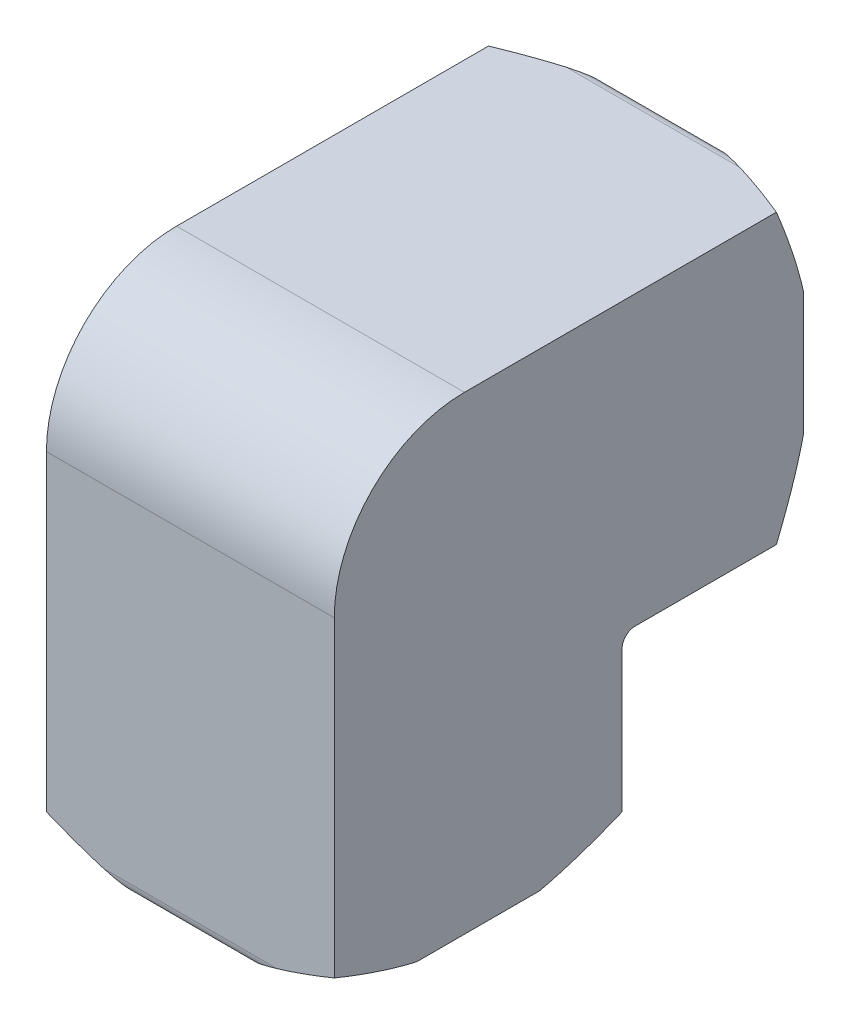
ISO-10303-21;
HEADER;
FILE_DESCRIPTION(('STEP AP214'),'2;1');
FILE_NAME('part.step','',(''),(''),'','','');
FILE_SCHEMA(('AUTOMOTIVE_DESIGN { 1 0 10303 214 1 1 1 1 }'));
ENDSEC;
DATA;
#1=APPLICATION_CONTEXT('core data for automotive mechanical design processes');
#2=APPLICATION_PROTOCOL_DEFINITION('international standard','automotive_design',2000,#1);
#3=PRODUCT_CONTEXT('',#1,'mechanical');
#4=PRODUCT('Part','Part','',(#3));
#5=PRODUCT_RELATED_PRODUCT_CATEGORY('part','',(#4));
#6=PRODUCT_DEFINITION_FORMATION('','',#4);
#7=PRODUCT_DEFINITION_CONTEXT('part definition',#1,'design');
#8=PRODUCT_DEFINITION('design','',#6,#7);
#9=PRODUCT_DEFINITION_SHAPE('','',#8);
#10=(LENGTH_UNIT() NAMED_UNIT(*) SI_UNIT(.MILLI.,.METRE.));
#11=(NAMED_UNIT(*) PLANE_ANGLE_UNIT() SI_UNIT($,.RADIAN.));
#12=(NAMED_UNIT(*) SI_UNIT($,.STERADIAN.) SOLID_ANGLE_UNIT());
#13=UNCERTAINTY_MEASURE_WITH_UNIT(LENGTH_MEASURE(1.E-05),#10,'distance_accuracy_value','');
#14=(GEOMETRIC_REPRESENTATION_CONTEXT(3) GLOBAL_UNCERTAINTY_ASSIGNED_CONTEXT((#13)) GLOBAL_UNIT_ASSIGNED_CONTEXT((#10,
#11,#12)) REPRESENTATION_CONTEXT('',''));
#15=CARTESIAN_POINT('',(0.,0.,0.));
#16=DIRECTION('',(0.,0.,1.));
#17=DIRECTION('',(1.,0.,0.));
#18=AXIS2_PLACEMENT_3D('',#15,#16,#17);
#19=CARTESIAN_POINT('',(0.,-8.00735,0.));
#20=DIRECTION('',(0.,1.,0.));
#21=DIRECTION('',(0.,0.,1.));
#22=AXIS2_PLACEMENT_3D('',#19,#20,#21);
#23=CYLINDRICAL_SURFACE('',#22,5.6007);
#24=CARTESIAN_POINT('',(0.,2.28600000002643,0.));
#25=DIRECTION('',(0.,-1.,0.));
#26=DIRECTION('',(0.,0.,-1.));
#27=AXIS2_PLACEMENT_3D('',#24,#25,#26);
#28=CIRCLE('',#27,5.6006999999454);
#29=CARTESIAN_POINT('',(5.11292914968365,2.28599999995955,2.28600000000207));
#30=VERTEX_POINT('',#29);
#31=CARTESIAN_POINT('',(5.1129291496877,2.28600000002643,-2.28599999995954));
#32=VERTEX_POINT('',#31);
#33=EDGE_CURVE('E190',#30,#32,#28,.F.);
#34=ORIENTED_EDGE('',*,*,#33,.T.);
#35=CARTESIAN_POINT('',(0.,0.,0.));
#36=DIRECTION('',(0.,0.707106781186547,0.707106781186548));
#37=DIRECTION('',(0.,0.707106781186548,-0.707106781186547));
#38=AXIS2_PLACEMENT_3D('',#35,#36,#37);
#39=ELLIPSE('',#38,7.92058589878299,5.6007);
#40=CARTESIAN_POINT('',(5.6007,0.,0.));
#41=VERTEX_POINT('',#40);
#42=EDGE_CURVE('E186',#32,#41,#39,.F.);
#43=ORIENTED_EDGE('',*,*,#42,.T.);
#44=CARTESIAN_POINT('',(0.,0.,0.));
#45=DIRECTION('',(0.,0.707106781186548,-0.707106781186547));
#46=DIRECTION('',(0.,0.707106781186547,0.707106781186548));
#47=AXIS2_PLACEMENT_3D('',#44,#45,#46);
#48=ELLIPSE('',#47,7.92058589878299,5.6007);
#49=EDGE_CURVE('E203',#41,#30,#48,.F.);
#50=ORIENTED_EDGE('',*,*,#49,.T.);
#51=EDGE_LOOP('',(#34,#43,#50));
#52=FACE_BOUND('',#51,.T.);
#53=ADVANCED_FACE('F16',(#52),#23,.F.);
#54=CARTESIAN_POINT('',(0.,-8.00735,0.));
#55=DIRECTION('',(0.,1.,0.));
#56=DIRECTION('',(0.,0.,1.));
#57=AXIS2_PLACEMENT_3D('',#54,#55,#56);
#58=CYLINDRICAL_SURFACE('',#57,5.6007);
#59=CARTESIAN_POINT('',(0.,2.28600000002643,0.));
#60=DIRECTION('',(0.,-1.,0.));
#61=DIRECTION('',(0.,0.,-1.));
#62=AXIS2_PLACEMENT_3D('',#59,#60,#61);
#63=CIRCLE('',#62,5.6006999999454);
#64=CARTESIAN_POINT('',(-5.1129291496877,2.28600000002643,-2.28599999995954));
#65=VERTEX_POINT('',#64);
#66=CARTESIAN_POINT('',(-5.11292914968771,2.28600000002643,2.28599999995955));
#67=VERTEX_POINT('',#66);
#68=EDGE_CURVE('E194',#65,#67,#63,.F.);
#69=ORIENTED_EDGE('',*,*,#68,.T.);
#70=CARTESIAN_POINT('',(0.,0.,0.));
#71=DIRECTION('',(0.,0.707106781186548,-0.707106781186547));
#72=DIRECTION('',(0.,0.707106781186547,0.707106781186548));
#73=AXIS2_PLACEMENT_3D('',#70,#71,#72);
#74=ELLIPSE('',#73,7.92058589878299,5.6007);
#75=CARTESIAN_POINT('',(-5.6007,0.,0.));
#76=VERTEX_POINT('',#75);
#77=EDGE_CURVE('E208',#67,#76,#74,.F.);
#78=ORIENTED_EDGE('',*,*,#77,.T.);
#79=CARTESIAN_POINT('',(0.,0.,0.));
#80=DIRECTION('',(0.,0.707106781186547,0.707106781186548));
#81=DIRECTION('',(0.,0.707106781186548,-0.707106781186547));
#82=AXIS2_PLACEMENT_3D('',#79,#80,#81);
#83=ELLIPSE('',#82,7.92058589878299,5.6007);
#84=EDGE_CURVE('E515',#76,#65,#83,.F.);
#85=ORIENTED_EDGE('',*,*,#84,.T.);
#86=EDGE_LOOP('',(#69,#78,#85));
#87=FACE_BOUND('',#86,.T.);
#88=ADVANCED_FACE('F509',(#87),#58,.F.);
#89=CARTESIAN_POINT('',(0.,2.28600000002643,0.));
#90=DIRECTION('',(0.,-1.,0.));
#91=DIRECTION('',(0.,0.,-1.));
#92=AXIS2_PLACEMENT_3D('',#89,#90,#91);
#93=CONICAL_SURFACE('',#92,5.6006999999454,1.08210413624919);
#94=ORIENTED_EDGE('',*,*,#68,.F.);
#95=CARTESIAN_POINT('',(-5.11292914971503,2.28599999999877,-2.28599999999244));
#96=CARTESIAN_POINT('',(-5.08813694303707,2.34156057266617,-2.0852513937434));
#97=CARTESIAN_POINT('',(-5.06401734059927,2.39295095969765,-1.88295175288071));
#98=CARTESIAN_POINT('',(-5.02006394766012,2.48379647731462,-1.47429086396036));
#99=CARTESIAN_POINT('',(-5.00025039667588,2.52319557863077,-1.26791520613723));
#100=CARTESIAN_POINT('',(-4.96861805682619,2.58493726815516,-0.858256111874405));
#101=CARTESIAN_POINT('',(-4.95657638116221,2.60775798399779,-0.655066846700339));
#102=CARTESIAN_POINT('',(-4.94211652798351,2.6350695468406,-0.247511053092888));
#103=CARTESIAN_POINT('',(-4.93967599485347,2.63960297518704,-0.0431483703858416));
#104=CARTESIAN_POINT('',(-4.94457465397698,2.63040267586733,0.338916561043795));
#105=CARTESIAN_POINT('',(-4.95070669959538,2.61892413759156,0.516696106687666));
#106=CARTESIAN_POINT('',(-4.96959402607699,2.5829020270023,0.870856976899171));
#107=CARTESIAN_POINT('',(-4.98236177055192,2.55833386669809,1.04723503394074));
#108=CARTESIAN_POINT('',(-5.01307926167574,2.49760516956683,1.40243194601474));
#109=CARTESIAN_POINT('',(-5.03116092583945,2.46114655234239,1.58118603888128));
#110=CARTESIAN_POINT('',(-5.07030087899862,2.37949708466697,1.93565892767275));
#111=CARTESIAN_POINT('',(-5.09134755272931,2.33434006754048,2.11138669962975));
#112=CARTESIAN_POINT('',(-5.11292914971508,2.28599999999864,2.28599999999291));
#113=B_SPLINE_CURVE_WITH_KNOTS('',3,(#95,#96,#97,#98,#99,#100,#101,#102,#103,#104,#105,#106,
#107,#108,#109,#110,#111,#112),.UNSPECIFIED.,.F.,.F.,(4,2,2,2,2,2,2,2,4),(0.,0.629716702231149,
1.26233211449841,1.87588759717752,2.48801360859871,3.02209986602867,3.55719292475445,
4.10688979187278,4.65449022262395),.UNSPECIFIED.);
#114=EDGE_CURVE('E200',#65,#67,#113,.T.);
#115=ORIENTED_EDGE('',*,*,#114,.T.);
#116=EDGE_LOOP('',(#94,#115));
#117=FACE_BOUND('',#116,.T.);
#118=ADVANCED_FACE('F506',(#117),#93,.F.);
#119=CARTESIAN_POINT('',(0.,0.,2.28600000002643));
#120=DIRECTION('',(0.,0.,-1.));
#121=DIRECTION('',(0.,1.,0.));
#122=AXIS2_PLACEMENT_3D('',#119,#120,#121);
#123=CONICAL_SURFACE('',#122,5.6006999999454,1.0821041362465);
#124=CARTESIAN_POINT('',(0.,0.,2.286));
#125=DIRECTION('',(0.,0.,1.));
#126=DIRECTION('',(1.,0.,0.));
#127=AXIS2_PLACEMENT_3D('',#124,#125,#126);
#128=CIRCLE('',#127,5.6007);
#129=EDGE_CURVE('E183',#67,#30,#128,.F.);
#130=ORIENTED_EDGE('',*,*,#129,.T.);
#131=CARTESIAN_POINT('',(5.11292914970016,2.28600000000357,2.28600000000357));
#132=CARTESIAN_POINT('',(4.97864379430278,2.33954960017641,2.33954960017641));
#133=CARTESIAN_POINT('',(4.84359892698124,2.39216183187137,2.39216183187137));
#134=CARTESIAN_POINT('',(4.57180281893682,2.4951946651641,2.49519466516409));
#135=CARTESIAN_POINT('',(4.43505113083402,2.54561467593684,2.54561467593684));
#136=CARTESIAN_POINT('',(4.15909810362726,2.64414124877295,2.64414124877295));
#137=CARTESIAN_POINT('',(4.01988843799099,2.6922362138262,2.6922362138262));
#138=CARTESIAN_POINT('',(3.73950436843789,2.78544503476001,2.78544503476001));
#139=CARTESIAN_POINT('',(3.59833009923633,2.8305590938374,2.8305590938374));
#140=CARTESIAN_POINT('',(3.16713535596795,2.96212631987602,2.96212631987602));
#141=CARTESIAN_POINT('',(2.87376627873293,3.04322778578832,3.04322778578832));
#142=CARTESIAN_POINT('',(2.27819257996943,3.18634819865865,3.18634819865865));
#143=CARTESIAN_POINT('',(1.97600490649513,3.24840140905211,3.24840140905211));
#144=CARTESIAN_POINT('',(1.46095133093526,3.33230205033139,3.33230205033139));
#145=CARTESIAN_POINT('',(1.25021367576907,3.36065966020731,3.36065966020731));
#146=CARTESIAN_POINT('',(0.826021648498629,3.4045266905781,3.4045266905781));
#147=CARTESIAN_POINT('',(0.612567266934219,3.42003606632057,3.42003606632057));
#148=CARTESIAN_POINT('',(0.186366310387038,3.43715665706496,3.43715665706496));
#149=CARTESIAN_POINT('',(-0.0263706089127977,3.43888604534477,3.43888604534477));
#150=CARTESIAN_POINT('',(-0.451174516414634,3.42865178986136,3.42865178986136));
#151=CARTESIAN_POINT('',(-0.663241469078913,3.4166874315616,3.4166874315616));
#152=CARTESIAN_POINT('',(-1.13298171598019,3.37560881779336,3.37560881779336));
#153=CARTESIAN_POINT('',(-1.39008130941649,3.3432183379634,3.3432183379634));
#154=CARTESIAN_POINT('',(-1.898848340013,3.26153938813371,3.26153938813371));
#155=CARTESIAN_POINT('',(-2.15051282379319,3.21224196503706,3.21224196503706));
#156=CARTESIAN_POINT('',(-2.64955730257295,3.09942852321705,3.09942852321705));
#157=CARTESIAN_POINT('',(-2.89688515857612,3.03579909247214,3.03579909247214));
#158=CARTESIAN_POINT('',(-3.3851691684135,2.89753500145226,2.89753500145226));
#159=CARTESIAN_POINT('',(-3.62612647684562,2.82290235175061,2.82290235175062));
#160=CARTESIAN_POINT('',(-4.07767264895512,2.67322202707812,2.67322202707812));
#161=CARTESIAN_POINT('',(-4.28882485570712,2.59901564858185,2.59901564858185));
#162=CARTESIAN_POINT('',(-4.60138929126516,2.48396998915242,2.48396998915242));
#163=CARTESIAN_POINT('',(-4.70435015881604,2.4452132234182,2.4452132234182));
#164=CARTESIAN_POINT('',(-4.90932796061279,2.3664851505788,2.3664851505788));
#165=CARTESIAN_POINT('',(-5.01134497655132,2.3265139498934,2.3265139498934));
#166=CARTESIAN_POINT('',(-5.11292914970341,2.28600000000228,2.28600000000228));
#167=B_SPLINE_CURVE_WITH_KNOTS('',3,(#131,#132,#133,#134,#135,#136,#137,#138,#139,#140,#141,
#142,#143,#144,#145,#146,#147,#148,#149,#150,#151,#152,#153,#154,#155,#156,#157,#158,#159,#160,
#161,#162,#163,#164,#165,#166),.UNSPECIFIED.,.F.,.F.,(4,2,2,2,2,2,2,2,2,2,2,2,2,2,2,2,2,4),(0.,
0.462510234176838,0.925144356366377,1.38988796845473,1.854599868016,2.7985900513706,
3.74087212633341,4.38374551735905,5.02662114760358,5.66397766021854,6.30136743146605,
7.08342885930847,7.86590507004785,8.65480542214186,9.44356179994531,10.1507387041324,
10.5006481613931,10.8505270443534),.UNSPECIFIED.);
#168=EDGE_CURVE('E19',#30,#67,#167,.T.);
#169=ORIENTED_EDGE('',*,*,#168,.T.);
#170=EDGE_LOOP('',(#130,#169));
#171=FACE_BOUND('',#170,.T.);
#172=ADVANCED_FACE('F198',(#171),#123,.F.);
#173=CARTESIAN_POINT('',(0.,2.28600000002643,0.));
#174=DIRECTION('',(0.,-1.,0.));
#175=DIRECTION('',(0.,0.,-1.));
#176=AXIS2_PLACEMENT_3D('',#173,#174,#175);
#177=CONICAL_SURFACE('',#176,5.6006999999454,1.08210413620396);
#178=ORIENTED_EDGE('',*,*,#33,.F.);
#179=CARTESIAN_POINT('',(5.11292914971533,2.28599999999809,2.28599999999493));
#180=CARTESIAN_POINT('',(5.08813694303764,2.34156057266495,2.08525139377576));
#181=CARTESIAN_POINT('',(5.0640173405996,2.392950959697,1.88295175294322));
#182=CARTESIAN_POINT('',(5.02006394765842,2.48379647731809,1.47429086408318));
#183=CARTESIAN_POINT('',(5.00025039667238,2.52319557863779,1.2679152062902));
#184=CARTESIAN_POINT('',(4.96861805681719,2.58493726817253,0.858256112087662));
#185=CARTESIAN_POINT('',(4.95657638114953,2.60775798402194,0.655066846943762));
#186=CARTESIAN_POINT('',(4.94211652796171,2.63506954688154,0.247511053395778));
#187=CARTESIAN_POINT('',(4.93967599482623,2.63960297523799,0.0431483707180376));
#188=CARTESIAN_POINT('',(4.94457465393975,2.63040267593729,-0.338916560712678));
#189=CARTESIAN_POINT('',(4.95070669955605,2.6189241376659,-0.516696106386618));
#190=CARTESIAN_POINT('',(4.96959402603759,2.58290202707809,-0.870856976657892));
#191=CARTESIAN_POINT('',(4.98236177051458,2.55833386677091,-1.04723503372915));
#192=CARTESIAN_POINT('',(5.01307926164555,2.49760516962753,-1.40243194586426));
#193=CARTESIAN_POINT('',(5.03116092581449,2.46114655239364,-1.58118603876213));
#194=CARTESIAN_POINT('',(5.07030087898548,2.37949708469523,-1.93565892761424));
#195=CARTESIAN_POINT('',(5.09134755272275,2.33434006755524,-2.11138669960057));
#196=CARTESIAN_POINT('',(5.11292914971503,2.28599999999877,-2.28599999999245));
#197=B_SPLINE_CURVE_WITH_KNOTS('',3,(#179,#180,#181,#182,#183,#184,#185,#186,#187,#188,#189,
#190,#191,#192,#193,#194,#195,#196),.UNSPECIFIED.,.F.,.F.,(4,2,2,2,2,2,2,2,4),(0.,
0.629716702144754,1.26233211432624,1.87588759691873,2.48801360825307,3.02209986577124,
3.5571929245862,4.10688979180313,4.65449022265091),.UNSPECIFIED.);
#198=EDGE_CURVE('E177',#30,#32,#197,.T.);
#199=ORIENTED_EDGE('',*,*,#198,.T.);
#200=EDGE_LOOP('',(#178,#199));
#201=FACE_BOUND('',#200,.T.);
#202=ADVANCED_FACE('F191',(#201),#177,.F.);
#203=CARTESIAN_POINT('',(0.,2.28600000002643,0.));
#204=DIRECTION('',(0.,-1.,0.));
#205=DIRECTION('',(0.,0.,-1.));
#206=AXIS2_PLACEMENT_3D('',#203,#204,#205);
#207=CONICAL_SURFACE('',#206,5.6006999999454,1.0821041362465);
#208=CARTESIAN_POINT('',(0.,2.286,0.));
#209=DIRECTION('',(0.,1.,0.));
#210=DIRECTION('',(-1.,0.,0.));
#211=AXIS2_PLACEMENT_3D('',#208,#209,#210);
#212=CIRCLE('',#211,5.6007);
#213=EDGE_CURVE('E188',#30,#67,#212,.F.);
#214=ORIENTED_EDGE('',*,*,#213,.T.);
#215=ORIENTED_EDGE('',*,*,#168,.F.);
#216=EDGE_LOOP('',(#214,#215));
#217=FACE_BOUND('',#216,.T.);
#218=ADVANCED_FACE('F219',(#217),#207,.F.);
#219=CARTESIAN_POINT('',(0.,0.,2.28600000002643));
#220=DIRECTION('',(0.,0.,-1.));
#221=DIRECTION('',(0.,1.,0.));
#222=AXIS2_PLACEMENT_3D('',#219,#220,#221);
#223=CONICAL_SURFACE('',#222,5.6006999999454,1.08210413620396);
#224=CARTESIAN_POINT('',(0.,0.,2.286));
#225=DIRECTION('',(0.,0.,1.));
#226=DIRECTION('',(1.,0.,0.));
#227=AXIS2_PLACEMENT_3D('',#224,#225,#226);
#228=CIRCLE('',#227,5.6007);
#229=CARTESIAN_POINT('',(-5.11292914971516,-2.2859999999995,2.28599999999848));
#230=VERTEX_POINT('',#229);
#231=EDGE_CURVE('E222',#230,#67,#228,.F.);
#232=ORIENTED_EDGE('',*,*,#231,.T.);
#233=CARTESIAN_POINT('',(-5.11292914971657,2.28600000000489,2.28599999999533));
#234=CARTESIAN_POINT('',(-5.08813694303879,2.08525139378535,2.34156057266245));
#235=CARTESIAN_POINT('',(-5.06401734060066,1.88295175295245,2.39295095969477));
#236=CARTESIAN_POINT('',(-5.02006394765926,1.47429086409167,2.48379647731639));
#237=CARTESIAN_POINT('',(-5.0002503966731,1.26791520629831,2.52319557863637));
#238=CARTESIAN_POINT('',(-4.96861805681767,0.858256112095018,2.58493726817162));
#239=CARTESIAN_POINT('',(-4.95657638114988,0.655066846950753,2.60775798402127));
#240=CARTESIAN_POINT('',(-4.94211652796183,0.247511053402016,2.63506954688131));
#241=CARTESIAN_POINT('',(-4.93967599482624,0.0431483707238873,2.63960297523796));
#242=CARTESIAN_POINT('',(-4.94457465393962,-0.33891656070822,2.63040267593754));
#243=CARTESIAN_POINT('',(-4.9507066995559,-0.51669610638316,2.61892413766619));
#244=CARTESIAN_POINT('',(-4.96959402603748,-0.870856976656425,2.5829020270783));
#245=CARTESIAN_POINT('',(-4.98236177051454,-1.04723503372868,2.558333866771));
#246=CARTESIAN_POINT('',(-5.01307926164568,-1.4024319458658,2.49760516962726));
#247=CARTESIAN_POINT('',(-5.03116092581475,-1.5811860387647,2.46114655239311));
#248=CARTESIAN_POINT('',(-5.07030087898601,-1.93565892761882,2.37949708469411));
#249=CARTESIAN_POINT('',(-5.09134755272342,-2.11138669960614,2.33434006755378));
#250=CARTESIAN_POINT('',(-5.11292914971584,-2.28599999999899,2.28599999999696));
#251=B_SPLINE_CURVE_WITH_KNOTS('',3,(#233,#234,#235,#236,#237,#238,#239,#240,#241,#242,#243,
#244,#245,#246,#247,#248,#249,#250),.UNSPECIFIED.,.F.,.F.,(4,2,2,2,2,2,2,2,4),(0.,
0.629716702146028,1.26233211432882,1.87588759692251,2.48801360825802,3.02209986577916,
3.55719292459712,4.10688979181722,4.65449022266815),.UNSPECIFIED.);
#252=EDGE_CURVE('E231',#67,#230,#251,.T.);
#253=ORIENTED_EDGE('',*,*,#252,.T.);
#254=EDGE_LOOP('',(#232,#253));
#255=FACE_BOUND('',#254,.T.);
#256=ADVANCED_FACE('F493',(#255),#223,.F.);
#257=CARTESIAN_POINT('',(0.,0.,-13.21435));
#258=DIRECTION('',(0.,0.,1.));
#259=DIRECTION('',(1.,0.,0.));
#260=AXIS2_PLACEMENT_3D('',#257,#258,#259);
#261=CYLINDRICAL_SURFACE('',#260,5.6007);
#262=ORIENTED_EDGE('',*,*,#77,.F.);
#263=ORIENTED_EDGE('',*,*,#231,.F.);
#264=CARTESIAN_POINT('',(0.,0.,0.));
#265=DIRECTION('',(0.,0.707106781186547,0.707106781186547));
#266=DIRECTION('',(0.,-0.707106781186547,0.707106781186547));
#267=AXIS2_PLACEMENT_3D('',#264,#265,#266);
#268=ELLIPSE('',#267,7.92058589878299,5.6007);
#269=EDGE_CURVE('E233',#230,#76,#268,.F.);
#270=ORIENTED_EDGE('',*,*,#269,.T.);
#271=EDGE_LOOP('',(#262,#263,#270));
#272=FACE_BOUND('',#271,.T.);
#273=ADVANCED_FACE('F497',(#272),#261,.F.);
#274=CARTESIAN_POINT('',(0.,0.,-13.21435));
#275=DIRECTION('',(0.,0.,1.));
#276=DIRECTION('',(1.,0.,0.));
#277=AXIS2_PLACEMENT_3D('',#274,#275,#276);
#278=CYLINDRICAL_SURFACE('',#277,5.6007);
#279=CARTESIAN_POINT('',(0.,0.,2.28600000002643));
#280=DIRECTION('',(0.,0.,-1.));
#281=DIRECTION('',(0.,-1.,0.));
#282=AXIS2_PLACEMENT_3D('',#279,#280,#281);
#283=CIRCLE('',#282,5.6006999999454);
#284=CARTESIAN_POINT('',(5.1129291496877,-2.28599999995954,2.28600000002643));
#285=VERTEX_POINT('',#284);
#286=EDGE_CURVE('E207',#285,#30,#283,.F.);
#287=ORIENTED_EDGE('',*,*,#286,.T.);
#288=ORIENTED_EDGE('',*,*,#49,.F.);
#289=CARTESIAN_POINT('',(0.,0.,0.));
#290=DIRECTION('',(0.,0.707106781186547,0.707106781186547));
#291=DIRECTION('',(0.,-0.707106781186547,0.707106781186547));
#292=AXIS2_PLACEMENT_3D('',#289,#290,#291);
#293=ELLIPSE('',#292,7.92058589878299,5.6007);
#294=EDGE_CURVE('E212',#41,#285,#293,.F.);
#295=ORIENTED_EDGE('',*,*,#294,.T.);
#296=EDGE_LOOP('',(#287,#288,#295));
#297=FACE_BOUND('',#296,.T.);
#298=ADVANCED_FACE('F211',(#297),#278,.F.);
#299=CARTESIAN_POINT('',(0.,0.,2.28600000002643));
#300=DIRECTION('',(0.,0.,-1.));
#301=DIRECTION('',(0.,1.,0.));
#302=AXIS2_PLACEMENT_3D('',#299,#300,#301);
#303=CONICAL_SURFACE('',#302,5.6006999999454,1.08210413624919);
#304=ORIENTED_EDGE('',*,*,#286,.F.);
#305=CARTESIAN_POINT('',(5.11292914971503,-2.28599999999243,2.28599999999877));
#306=CARTESIAN_POINT('',(5.08813694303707,-2.08525139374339,2.34156057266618));
#307=CARTESIAN_POINT('',(5.06401734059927,-1.88295175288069,2.39295095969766));
#308=CARTESIAN_POINT('',(5.02006394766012,-1.47429086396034,2.48379647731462));
#309=CARTESIAN_POINT('',(5.00025039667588,-1.26791520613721,2.52319557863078));
#310=CARTESIAN_POINT('',(4.96861805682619,-0.858256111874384,2.58493726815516));
#311=CARTESIAN_POINT('',(4.95657638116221,-0.655066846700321,2.60775798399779));
#312=CARTESIAN_POINT('',(4.94211652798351,-0.247511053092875,2.6350695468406));
#313=CARTESIAN_POINT('',(4.93967599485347,-0.0431483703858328,2.63960297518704));
#314=CARTESIAN_POINT('',(4.94457465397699,0.338916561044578,2.63040267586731));
#315=CARTESIAN_POINT('',(4.95070669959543,0.516696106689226,2.61892413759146));
#316=CARTESIAN_POINT('',(4.96959402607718,0.870856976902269,2.58290202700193));
#317=CARTESIAN_POINT('',(4.98236177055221,1.0472350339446,2.55833386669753));
#318=CARTESIAN_POINT('',(5.01307926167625,1.40243194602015,2.49760516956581));
#319=CARTESIAN_POINT('',(5.03116092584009,1.58118603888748,2.46114655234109));
#320=CARTESIAN_POINT('',(5.07030087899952,1.93565892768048,2.37949708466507));
#321=CARTESIAN_POINT('',(5.09134755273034,2.11138669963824,2.33434006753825));
#322=CARTESIAN_POINT('',(5.11292914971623,2.28600000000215,2.28599999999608));
#323=B_SPLINE_CURVE_WITH_KNOTS('',3,(#305,#306,#307,#308,#309,#310,#311,#312,#313,#314,#315,
#316,#317,#318,#319,#320,#321,#322),.UNSPECIFIED.,.F.,.F.,(4,2,2,2,2,2,2,2,4),(0.,
0.629716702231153,1.26233211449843,1.87588759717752,2.4880136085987,3.022099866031,
3.55719292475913,4.10688979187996,4.65449022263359),.UNSPECIFIED.);
#324=EDGE_CURVE('E223',#285,#30,#323,.T.);
#325=ORIENTED_EDGE('',*,*,#324,.T.);
#326=EDGE_LOOP('',(#304,#325));
#327=FACE_BOUND('',#326,.T.);
#328=ADVANCED_FACE('F224',(#327),#303,.F.);
#329=CARTESIAN_POINT('',(0.,0.,-13.21435));
#330=DIRECTION('',(0.,0.,1.));
#331=DIRECTION('',(1.,0.,0.));
#332=AXIS2_PLACEMENT_3D('',#329,#330,#331);
#333=CYLINDRICAL_SURFACE('',#332,5.6007);
#334=ORIENTED_EDGE('',*,*,#129,.F.);
#335=ORIENTED_EDGE('',*,*,#114,.F.);
#336=ORIENTED_EDGE('',*,*,#84,.F.);
#337=CARTESIAN_POINT('',(0.,0.,0.));
#338=DIRECTION('',(0.,-0.707106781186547,0.707106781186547));
#339=DIRECTION('',(0.,0.707106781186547,0.707106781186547));
#340=AXIS2_PLACEMENT_3D('',#337,#338,#339);
#341=ELLIPSE('',#340,7.92058589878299,5.6007);
#342=EDGE_CURVE('E524',#76,#41,#341,.T.);
#343=ORIENTED_EDGE('',*,*,#342,.T.);
#344=ORIENTED_EDGE('',*,*,#42,.F.);
#345=ORIENTED_EDGE('',*,*,#198,.F.);
#346=EDGE_LOOP('',(#334,#335,#336,#343,#344,#345));
#347=FACE_BOUND('',#346,.T.);
#348=CARTESIAN_POINT('',(0.,0.,-17.8001836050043));
#349=DIRECTION('',(0.,0.,-1.));
#350=DIRECTION('',(0.,-1.,0.));
#351=AXIS2_PLACEMENT_3D('',#348,#349,#350);
#352=CIRCLE('',#351,5.60070000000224);
#353=CARTESIAN_POINT('',(0.,-5.60070000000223,-17.8001836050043));
#354=VERTEX_POINT('',#353);
#355=EDGE_CURVE('E226',#354,#354,#352,.T.);
#356=ORIENTED_EDGE('',*,*,#355,.T.);
#357=EDGE_LOOP('',(#356));
#358=FACE_BOUND('',#357,.T.);
#359=ADVANCED_FACE('F179',(#347,#358),#333,.F.);
#360=CARTESIAN_POINT('',(0.,-13.21435,0.));
#361=DIRECTION('',(0.,1.,0.));
#362=DIRECTION('',(-1.,0.,0.));
#363=AXIS2_PLACEMENT_3D('',#360,#361,#362);
#364=CYLINDRICAL_SURFACE('',#363,5.6007);
#365=CARTESIAN_POINT('',(0.,-17.8001836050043,0.));
#366=DIRECTION('',(0.,-1.,0.));
#367=DIRECTION('',(0.,0.,-1.));
#368=AXIS2_PLACEMENT_3D('',#365,#366,#367);
#369=CIRCLE('',#368,5.60070000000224);
#370=CARTESIAN_POINT('',(0.,-17.8001836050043,-5.60070000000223));
#371=VERTEX_POINT('',#370);
#372=EDGE_CURVE('E464',#371,#371,#369,.T.);
#373=ORIENTED_EDGE('',*,*,#372,.T.);
#374=EDGE_LOOP('',(#373));
#375=FACE_BOUND('',#374,.T.);
#376=ORIENTED_EDGE('',*,*,#294,.F.);
#377=ORIENTED_EDGE('',*,*,#342,.F.);
#378=ORIENTED_EDGE('',*,*,#269,.F.);
#379=ORIENTED_EDGE('',*,*,#252,.F.);
#380=ORIENTED_EDGE('',*,*,#213,.F.);
#381=ORIENTED_EDGE('',*,*,#324,.F.);
#382=EDGE_LOOP('',(#376,#377,#378,#379,#380,#381));
#383=FACE_BOUND('',#382,.T.);
#384=ADVANCED_FACE('F229',(#375,#383),#364,.F.);
#385=CARTESIAN_POINT('',(0.,0.,-18.3177243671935));
#386=DIRECTION('',(0.,0.,-1.));
#387=DIRECTION('',(-1.,0.,0.));
#388=AXIS2_PLACEMENT_3D('',#385,#386,#387);
#389=CONICAL_SURFACE('',#388,5.61772436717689,0.0328828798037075);
#390=ORIENTED_EDGE('',*,*,#355,.F.);
#391=EDGE_LOOP('',(#390));
#392=FACE_BOUND('',#391,.T.);
#393=CARTESIAN_POINT('',(0.,0.,-18.3177243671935));
#394=DIRECTION('',(0.,0.,-1.));
#395=DIRECTION('',(0.,-1.,0.));
#396=AXIS2_PLACEMENT_3D('',#393,#394,#395);
#397=CIRCLE('',#396,5.61772436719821);
#398=CARTESIAN_POINT('',(0.,-5.61772436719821,-18.3177243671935));
#399=VERTEX_POINT('',#398);
#400=EDGE_CURVE('E457',#399,#399,#397,.T.);
#401=ORIENTED_EDGE('',*,*,#400,.T.);
#402=EDGE_LOOP('',(#401));
#403=FACE_BOUND('',#402,.T.);
#404=ADVANCED_FACE('F478',(#392,#403),#389,.F.);
#405=CARTESIAN_POINT('',(0.,-18.3177243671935,0.));
#406=DIRECTION('',(0.,-1.,0.));
#407=DIRECTION('',(0.,0.,-1.));
#408=AXIS2_PLACEMENT_3D('',#405,#406,#407);
#409=CONICAL_SURFACE('',#408,5.61772436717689,0.0328828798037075);
#410=ORIENTED_EDGE('',*,*,#372,.F.);
#411=EDGE_LOOP('',(#410));
#412=FACE_BOUND('',#411,.T.);
#413=CARTESIAN_POINT('',(0.,-18.3177243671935,0.));
#414=DIRECTION('',(0.,-1.,0.));
#415=DIRECTION('',(0.,0.,-1.));
#416=AXIS2_PLACEMENT_3D('',#413,#414,#415);
#417=CIRCLE('',#416,5.61772436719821);
#418=CARTESIAN_POINT('',(0.,-18.3177243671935,-5.61772436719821));
#419=VERTEX_POINT('',#418);
#420=EDGE_CURVE('E305',#419,#419,#417,.T.);
#421=ORIENTED_EDGE('',*,*,#420,.T.);
#422=EDGE_LOOP('',(#421));
#423=FACE_BOUND('',#422,.T.);
#424=ADVANCED_FACE('F611',(#412,#423),#409,.F.);
#425=CARTESIAN_POINT('',(0.,-9.5504,-9.5504));
#426=DIRECTION('',(1.,0.,0.));
#427=DIRECTION('',(0.,0.,-1.));
#428=AXIS2_PLACEMENT_3D('',#425,#426,#427);
#429=CYLINDRICAL_SURFACE('',#428,0.787399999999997);
#430=DIRECTION('',(1.,0.,0.));
#431=VECTOR('',#430,1.);
#432=CARTESIAN_POINT('',(0.,-9.5504,-8.763));
#433=LINE('',#432,#431);
#434=CARTESIAN_POINT('',(-8.763,-9.5504,-8.763));
#435=VERTEX_POINT('',#434);
#436=CARTESIAN_POINT('',(8.763,-9.5504,-8.763));
#437=VERTEX_POINT('',#436);
#438=EDGE_CURVE('E584',#435,#437,#433,.T.);
#439=ORIENTED_EDGE('',*,*,#438,.F.);
#440=CARTESIAN_POINT('',(-8.763,-9.5504,-9.5504));
#441=DIRECTION('',(1.,0.,0.));
#442=DIRECTION('',(0.,0.,-1.));
#443=AXIS2_PLACEMENT_3D('',#440,#441,#442);
#444=CIRCLE('',#443,0.787399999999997);
#445=CARTESIAN_POINT('',(-8.763,-8.763,-9.5504));
#446=VERTEX_POINT('',#445);
#447=EDGE_CURVE('E655',#435,#446,#444,.F.);
#448=ORIENTED_EDGE('',*,*,#447,.T.);
#449=DIRECTION('',(1.,0.,0.));
#450=VECTOR('',#449,1.);
#451=CARTESIAN_POINT('',(0.,-8.763,-9.5504));
#452=LINE('',#451,#450);
#453=CARTESIAN_POINT('',(8.763,-8.763,-9.5504));
#454=VERTEX_POINT('',#453);
#455=EDGE_CURVE('E581',#454,#446,#452,.F.);
#456=ORIENTED_EDGE('',*,*,#455,.F.);
#457=CARTESIAN_POINT('',(8.763,-9.5504,-9.5504));
#458=DIRECTION('',(1.,0.,0.));
#459=DIRECTION('',(0.,0.,-1.));
#460=AXIS2_PLACEMENT_3D('',#457,#458,#459);
#461=CIRCLE('',#460,0.787399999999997);
#462=EDGE_CURVE('E458',#437,#454,#461,.F.);
#463=ORIENTED_EDGE('',*,*,#462,.F.);
#464=EDGE_LOOP('',(#439,#448,#456,#463));
#465=FACE_BOUND('',#464,.T.);
#466=ADVANCED_FACE('F809',(#465),#429,.F.);
#467=CARTESIAN_POINT('',(0.,0.,-18.1463676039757));
#468=DIRECTION('',(0.,0.,1.));
#469=DIRECTION('',(1.,0.,0.));
#470=AXIS2_PLACEMENT_3D('',#467,#468,#469);
#471=CONICAL_SURFACE('',#470,12.4099599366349,1.0471975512);
#472=CARTESIAN_POINT('',(-5.27639438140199,-8.7630000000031,-19.4055999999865));
#473=CARTESIAN_POINT('',(-5.22211521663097,-8.76299866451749,-19.4217658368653));
#474=CARTESIAN_POINT('',(-5.16785483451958,-8.76250284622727,-19.4379875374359));
#475=CARTESIAN_POINT('',(-5.05938607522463,-8.76048541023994,-19.4705608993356));
#476=CARTESIAN_POINT('',(-5.00517770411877,-8.75896368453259,-19.4869125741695));
#477=CARTESIAN_POINT('',(-4.84292699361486,-8.75281429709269,-19.5361066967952));
#478=CARTESIAN_POINT('',(-4.73500074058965,-8.7466027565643,-19.5691649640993));
#479=CARTESIAN_POINT('',(-4.5735948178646,-8.73361309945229,-19.6194048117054));
#480=CARTESIAN_POINT('',(-4.51986298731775,-8.72866983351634,-19.6362635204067));
#481=CARTESIAN_POINT('',(-4.41264046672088,-8.71740241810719,-19.6702666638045));
#482=CARTESIAN_POINT('',(-4.35914974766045,-8.71107843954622,-19.6874110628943));
#483=CARTESIAN_POINT('',(-4.2523763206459,-8.6968289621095,-19.7221187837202));
#484=CARTESIAN_POINT('',(-4.19909435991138,-8.68889986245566,-19.7396829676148));
#485=CARTESIAN_POINT('',(-4.09303347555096,-8.67105063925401,-19.7753757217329));
#486=CARTESIAN_POINT('',(-4.04025476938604,-8.66112969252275,-19.7935045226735));
#487=CARTESIAN_POINT('',(-3.98783615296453,-8.65001663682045,-19.8119999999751));
#488=B_SPLINE_CURVE_WITH_KNOTS('',3,(#472,#473,#474,#475,#476,#477,#478,#479,#480,#481,#482,
#483,#484,#485,#486,#487),.UNSPECIFIED.,.F.,.F.,(4,2,2,2,2,2,2,4),(0.,0.169899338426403,
0.339816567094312,0.67884306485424,0.848422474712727,1.0179809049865,1.1879240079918,
1.35793748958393),.UNSPECIFIED.);
#489=CARTESIAN_POINT('',(-5.27639438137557,-8.76299999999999,-19.4055999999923));
#490=VERTEX_POINT('',#489);
#491=CARTESIAN_POINT('',(-3.98783615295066,-8.65001663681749,-19.81199999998));
#492=VERTEX_POINT('',#491);
#493=EDGE_CURVE('E451',#490,#492,#488,.T.);
#494=ORIENTED_EDGE('',*,*,#493,.F.);
#495=CARTESIAN_POINT('',(-8.76299999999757,-8.763,-18.1563017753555));
#496=CARTESIAN_POINT('',(-8.4770821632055,-8.763,-18.2729931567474));
#497=CARTESIAN_POINT('',(-8.19016907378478,-8.763,-18.3873020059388));
#498=CARTESIAN_POINT('',(-7.61425190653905,-8.763,-18.6099940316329));
#499=CARTESIAN_POINT('',(-7.32524916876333,-8.763,-18.7183806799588));
#500=CARTESIAN_POINT('',(-6.74466633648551,-8.763,-18.9282258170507));
#501=CARTESIAN_POINT('',(-6.45308582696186,-8.763,-19.0296831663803));
#502=CARTESIAN_POINT('',(-5.8669739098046,-8.763,-19.2242697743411));
#503=CARTESIAN_POINT('',(-5.57244085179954,-8.763,-19.3173940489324));
#504=CARTESIAN_POINT('',(-5.27639438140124,-8.763,-19.4055999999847));
#505=B_SPLINE_CURVE_WITH_KNOTS('',3,(#495,#496,#497,#498,#499,#500,#501,#502,#503,#504),
.UNSPECIFIED.,.F.,.F.,(4,2,2,2,4),(0.,0.926460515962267,1.85237194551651,2.77843526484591,
3.70504881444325),.UNSPECIFIED.);
#506=CARTESIAN_POINT('',(-8.76299999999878,-8.76299999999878,-18.1563017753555));
#507=VERTEX_POINT('',#506);
#508=EDGE_CURVE('E436',#507,#490,#505,.T.);
#509=ORIENTED_EDGE('',*,*,#508,.F.);
#510=CARTESIAN_POINT('',(-8.763,-8.76299999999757,-18.1563017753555));
#511=CARTESIAN_POINT('',(-8.763,-8.55840369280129,-18.2398186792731));
#512=CARTESIAN_POINT('',(-8.763,-8.35329756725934,-18.3220990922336));
#513=CARTESIAN_POINT('',(-8.763,-7.94195303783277,-18.4838167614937));
#514=CARTESIAN_POINT('',(-8.763,-7.73571456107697,-18.56325383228));
#515=CARTESIAN_POINT('',(-8.763,-7.32236572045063,-18.7187733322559));
#516=CARTESIAN_POINT('',(-8.763,-7.11525739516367,-18.7948611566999));
#517=CARTESIAN_POINT('',(-8.763,-6.6997367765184,-18.9433720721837));
#518=CARTESIAN_POINT('',(-8.763,-6.49132448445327,-19.0157951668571));
#519=CARTESIAN_POINT('',(-8.763,-5.86369434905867,-19.2269321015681));
#520=CARTESIAN_POINT('',(-8.763,-5.44232952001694,-19.3594196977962));
#521=CARTESIAN_POINT('',(-8.763,-4.80533285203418,-19.5421636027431));
#522=CARTESIAN_POINT('',(-8.763,-4.59199573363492,-19.6004555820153));
#523=CARTESIAN_POINT('',(-8.763,-4.16371302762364,-19.7109646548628));
#524=CARTESIAN_POINT('',(-8.763,-3.94876713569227,-19.7631805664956));
#525=CARTESIAN_POINT('',(-8.763,-3.73302236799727,-19.811999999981));
#526=B_SPLINE_CURVE_WITH_KNOTS('',3,(#510,#511,#512,#513,#514,#515,#516,#517,#518,#519,#520,
#521,#522,#523,#524,#525),.UNSPECIFIED.,.F.,.F.,(4,2,2,2,2,2,2,4),(0.,0.662959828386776,
1.32596283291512,1.98785550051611,2.64974751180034,3.97432180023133,4.63771639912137,
5.30123982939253),.UNSPECIFIED.);
#527=CARTESIAN_POINT('',(-8.763,-3.7330223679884,-19.811999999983));
#528=VERTEX_POINT('',#527);
#529=EDGE_CURVE('E339',#507,#528,#526,.T.);
#530=ORIENTED_EDGE('',*,*,#529,.T.);
#531=CARTESIAN_POINT('',(0.,0.,-19.811999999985));
#532=DIRECTION('',(0.,0.,1.));
#533=DIRECTION('',(1.,0.,0.));
#534=AXIS2_PLACEMENT_3D('',#531,#532,#533);
#535=CIRCLE('',#534,9.52499999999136);
#536=EDGE_CURVE('E569',#528,#492,#535,.T.);
#537=ORIENTED_EDGE('',*,*,#536,.T.);
#538=EDGE_LOOP('',(#494,#509,#530,#537));
#539=FACE_BOUND('',#538,.T.);
#540=ADVANCED_FACE('F445',(#539),#471,.T.);
#541=CARTESIAN_POINT('',(0.,-7.9756,-19.4056));
#542=DIRECTION('',(1.,0.,0.));
#543=DIRECTION('',(0.,0.,-1.));
#544=AXIS2_PLACEMENT_3D('',#541,#542,#543);
#545=CYLINDRICAL_SURFACE('',#544,0.787399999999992);
#546=ORIENTED_EDGE('',*,*,#493,.T.);
#547=DIRECTION('',(1.,0.,0.));
#548=VECTOR('',#547,1.);
#549=CARTESIAN_POINT('',(0.,-8.65001663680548,-19.812));
#550=LINE('',#549,#548);
#551=CARTESIAN_POINT('',(3.98783615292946,-8.65001663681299,-19.8119999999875));
#552=VERTEX_POINT('',#551);
#553=EDGE_CURVE('E566',#492,#552,#550,.T.);
#554=ORIENTED_EDGE('',*,*,#553,.T.);
#555=CARTESIAN_POINT('',(5.27639370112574,-8.76299999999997,-19.4056002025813));
#556=CARTESIAN_POINT('',(5.22211456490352,-8.76299866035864,-19.4217660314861));
#557=CARTESIAN_POINT('',(5.16785421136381,-8.762502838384,-19.4379877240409));
#558=CARTESIAN_POINT('',(5.05938550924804,-8.7604853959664,-19.4705610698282));
#559=CARTESIAN_POINT('',(5.00517716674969,-8.75896366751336,-19.4869127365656));
#560=CARTESIAN_POINT('',(4.84292654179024,-8.75281427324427,-19.5361068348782));
#561=CARTESIAN_POINT('',(4.73500034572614,-8.74660273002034,-19.5691650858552));
#562=CARTESIAN_POINT('',(4.57359450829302,-8.73361307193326,-19.6194049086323));
#563=CARTESIAN_POINT('',(4.51986270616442,-8.72866980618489,-19.6362636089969));
#564=CARTESIAN_POINT('',(4.41264024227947,-8.71740239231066,-19.6702667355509));
#565=CARTESIAN_POINT('',(4.35914955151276,-8.71107841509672,-19.6874111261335));
#566=CARTESIAN_POINT('',(4.25237618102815,-8.69682894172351,-19.7221188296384));
#567=CARTESIAN_POINT('',(4.19909424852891,-8.68889984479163,-19.739683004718));
#568=CARTESIAN_POINT('',(4.09303342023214,-8.67105062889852,-19.77537574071));
#569=CARTESIAN_POINT('',(4.04025474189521,-8.66112968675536,-19.7935045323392));
#570=CARTESIAN_POINT('',(3.98783615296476,-8.6500166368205,-19.811999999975));
#571=B_SPLINE_CURVE_WITH_KNOTS('',3,(#555,#556,#557,#558,#559,#560,#561,#562,#563,#564,#565,
#566,#567,#568,#569,#570),.UNSPECIFIED.,.F.,.F.,(4,2,2,2,2,2,2,4),(0.,0.169899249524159,
0.339816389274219,0.678842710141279,0.848422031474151,1.01798037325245,1.18792338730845,
1.3579367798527),.UNSPECIFIED.);
#572=CARTESIAN_POINT('',(5.27639404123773,-8.76299999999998,-19.4056001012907));
#573=VERTEX_POINT('',#572);
#574=EDGE_CURVE('E428',#573,#552,#571,.T.);
#575=ORIENTED_EDGE('',*,*,#574,.F.);
#576=DIRECTION('',(1.,0.,0.));
#577=VECTOR('',#576,1.);
#578=CARTESIAN_POINT('',(0.,-8.763,-19.4056));
#579=LINE('',#578,#577);
#580=EDGE_CURVE('E435',#490,#573,#579,.T.);
#581=ORIENTED_EDGE('',*,*,#580,.F.);
#582=EDGE_LOOP('',(#546,#554,#575,#581));
#583=FACE_BOUND('',#582,.T.);
#584=ADVANCED_FACE('F441',(#583),#545,.T.);
#585=CARTESIAN_POINT('',(0.,0.,-19.8120000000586));
#586=DIRECTION('',(0.,0.,-1.));
#587=DIRECTION('',(-1.,0.,0.));
#588=AXIS2_PLACEMENT_3D('',#585,#586,#587);
#589=CONICAL_SURFACE('',#588,7.11200000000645,0.785398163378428);
#590=CARTESIAN_POINT('',(0.,0.,-19.8120000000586));
#591=DIRECTION('',(0.,0.,-1.));
#592=DIRECTION('',(-1.,0.,0.));
#593=AXIS2_PLACEMENT_3D('',#590,#591,#592);
#594=CIRCLE('',#593,7.11200000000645);
#595=CARTESIAN_POINT('',(-7.11200000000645,0.,-19.8120000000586));
#596=VERTEX_POINT('',#595);
#597=EDGE_CURVE('E622',#596,#596,#594,.T.);
#598=ORIENTED_EDGE('',*,*,#597,.T.);
#599=EDGE_LOOP('',(#598));
#600=FACE_BOUND('',#599,.T.);
#601=ORIENTED_EDGE('',*,*,#400,.F.);
#602=EDGE_LOOP('',(#601));
#603=FACE_BOUND('',#602,.T.);
#604=ADVANCED_FACE('F444',(#600,#603),#589,.F.);
#605=CARTESIAN_POINT('',(0.,7.9756,-19.4056));
#606=DIRECTION('',(1.,0.,0.));
#607=DIRECTION('',(0.,0.,-1.));
#608=AXIS2_PLACEMENT_3D('',#605,#606,#607);
#609=CYLINDRICAL_SURFACE('',#608,0.787399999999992);
#610=CARTESIAN_POINT('',(-5.27639370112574,8.76299999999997,-19.4056002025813));
#611=CARTESIAN_POINT('',(-5.22211456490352,8.76299866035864,-19.4217660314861));
#612=CARTESIAN_POINT('',(-5.16785421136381,8.762502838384,-19.4379877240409));
#613=CARTESIAN_POINT('',(-5.05938550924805,8.7604853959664,-19.4705610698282));
#614=CARTESIAN_POINT('',(-5.00517716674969,8.75896366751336,-19.4869127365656));
#615=CARTESIAN_POINT('',(-4.84292654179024,8.75281427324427,-19.5361068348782));
#616=CARTESIAN_POINT('',(-4.73500034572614,8.74660273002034,-19.5691650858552));
#617=CARTESIAN_POINT('',(-4.57359450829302,8.73361307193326,-19.6194049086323));
#618=CARTESIAN_POINT('',(-4.51986270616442,8.72866980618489,-19.6362636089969));
#619=CARTESIAN_POINT('',(-4.41264024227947,8.71740239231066,-19.6702667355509));
#620=CARTESIAN_POINT('',(-4.35914955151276,8.71107841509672,-19.6874111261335));
#621=CARTESIAN_POINT('',(-4.25237618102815,8.69682894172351,-19.7221188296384));
#622=CARTESIAN_POINT('',(-4.1990942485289,8.68889984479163,-19.739683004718));
#623=CARTESIAN_POINT('',(-4.09303342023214,8.67105062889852,-19.77537574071));
#624=CARTESIAN_POINT('',(-4.04025474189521,8.66112968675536,-19.7935045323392));
#625=CARTESIAN_POINT('',(-3.98783615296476,8.6500166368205,-19.811999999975));
#626=B_SPLINE_CURVE_WITH_KNOTS('',3,(#610,#611,#612,#613,#614,#615,#616,#617,#618,#619,#620,
#621,#622,#623,#624,#625),.UNSPECIFIED.,.F.,.F.,(4,2,2,2,2,2,2,4),(0.,0.169899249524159,
0.339816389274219,0.67884271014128,0.848422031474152,1.01798037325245,1.18792338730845,
1.3579367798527),.UNSPECIFIED.);
#627=CARTESIAN_POINT('',(-5.27639370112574,8.76299999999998,-19.4056002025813));
#628=VERTEX_POINT('',#627);
#629=CARTESIAN_POINT('',(-3.98783615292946,8.65001663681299,-19.8119999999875));
#630=VERTEX_POINT('',#629);
#631=EDGE_CURVE('E459',#628,#630,#626,.T.);
#632=ORIENTED_EDGE('',*,*,#631,.F.);
#633=DIRECTION('',(1.,0.,0.));
#634=VECTOR('',#633,1.);
#635=CARTESIAN_POINT('',(0.,8.76299999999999,-19.4056));
#636=LINE('',#635,#634);
#637=CARTESIAN_POINT('',(5.27639438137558,8.76299999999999,-19.4055999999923));
#638=VERTEX_POINT('',#637);
#639=EDGE_CURVE('E367',#638,#628,#636,.F.);
#640=ORIENTED_EDGE('',*,*,#639,.F.);
#641=CARTESIAN_POINT('',(3.98783615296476,8.6500166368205,-19.811999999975));
#642=CARTESIAN_POINT('',(4.04025476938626,8.66112969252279,-19.7935045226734));
#643=CARTESIAN_POINT('',(4.09303347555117,8.67105063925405,-19.7753757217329));
#644=CARTESIAN_POINT('',(4.19909435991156,8.68889986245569,-19.7396829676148));
#645=CARTESIAN_POINT('',(4.25237632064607,8.69682896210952,-19.7221187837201));
#646=CARTESIAN_POINT('',(4.35914974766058,8.71107843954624,-19.6874110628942));
#647=CARTESIAN_POINT('',(4.41264046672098,8.7174024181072,-19.6702666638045));
#648=CARTESIAN_POINT('',(4.51986298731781,8.72866983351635,-19.6362635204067));
#649=CARTESIAN_POINT('',(4.57359481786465,8.73361309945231,-19.6194048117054));
#650=CARTESIAN_POINT('',(4.73500074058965,8.74660275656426,-19.5691649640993));
#651=CARTESIAN_POINT('',(4.8429269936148,8.75281429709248,-19.5361066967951));
#652=CARTESIAN_POINT('',(5.00517770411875,8.7589636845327,-19.4869125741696));
#653=CARTESIAN_POINT('',(5.05938607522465,8.76048541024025,-19.4705608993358));
#654=CARTESIAN_POINT('',(5.16785483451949,8.76250284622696,-19.4379875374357));
#655=CARTESIAN_POINT('',(5.22211521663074,8.76299866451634,-19.4217658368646));
#656=CARTESIAN_POINT('',(5.27639438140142,8.76299999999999,-19.4055999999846));
#657=B_SPLINE_CURVE_WITH_KNOTS('',3,(#641,#642,#643,#644,#645,#646,#647,#648,#649,#650,#651,
#652,#653,#654,#655,#656),.UNSPECIFIED.,.F.,.F.,(4,2,2,2,2,2,2,4),(0.,0.170013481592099,
0.339956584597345,0.509515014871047,0.679094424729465,1.01812092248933,1.18803815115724,
1.35793748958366),.UNSPECIFIED.);
#658=CARTESIAN_POINT('',(3.98783615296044,8.65001663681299,-19.81199999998));
#659=VERTEX_POINT('',#658);
#660=EDGE_CURVE('E624',#659,#638,#657,.T.);
#661=ORIENTED_EDGE('',*,*,#660,.F.);
#662=DIRECTION('',(1.,0.,0.));
#663=VECTOR('',#662,1.);
#664=CARTESIAN_POINT('',(0.,8.65001663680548,-19.812));
#665=LINE('',#664,#663);
#666=EDGE_CURVE('E574',#659,#630,#665,.F.);
#667=ORIENTED_EDGE('',*,*,#666,.T.);
#668=EDGE_LOOP('',(#632,#640,#661,#667));
#669=FACE_BOUND('',#668,.T.);
#670=ADVANCED_FACE('F350',(#669),#609,.T.);
#671=CARTESIAN_POINT('',(0.,0.,-18.1463676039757));
#672=DIRECTION('',(0.,0.,1.));
#673=DIRECTION('',(1.,0.,0.));
#674=AXIS2_PLACEMENT_3D('',#671,#672,#673);
#675=CONICAL_SURFACE('',#674,12.4099599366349,1.0471975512);
#676=CARTESIAN_POINT('',(-8.763,3.73302236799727,-19.811999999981));
#677=CARTESIAN_POINT('',(-8.763,3.94876713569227,-19.7631805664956));
#678=CARTESIAN_POINT('',(-8.763,4.16371302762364,-19.7109646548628));
#679=CARTESIAN_POINT('',(-8.763,4.59199573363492,-19.6004555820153));
#680=CARTESIAN_POINT('',(-8.763,4.80533285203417,-19.5421636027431));
#681=CARTESIAN_POINT('',(-8.763,5.44232952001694,-19.3594196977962));
#682=CARTESIAN_POINT('',(-8.763,5.86369434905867,-19.2269321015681));
#683=CARTESIAN_POINT('',(-8.763,6.49132448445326,-19.0157951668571));
#684=CARTESIAN_POINT('',(-8.763,6.69973677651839,-18.9433720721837));
#685=CARTESIAN_POINT('',(-8.763,7.11525739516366,-18.7948611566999));
#686=CARTESIAN_POINT('',(-8.763,7.32236572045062,-18.7187733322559));
#687=CARTESIAN_POINT('',(-8.763,7.73571456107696,-18.56325383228));
#688=CARTESIAN_POINT('',(-8.763,7.94195303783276,-18.4838167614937));
#689=CARTESIAN_POINT('',(-8.763,8.35329756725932,-18.3220990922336));
#690=CARTESIAN_POINT('',(-8.763,8.55840369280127,-18.2398186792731));
#691=CARTESIAN_POINT('',(-8.763,8.76299999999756,-18.1563017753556));
#692=B_SPLINE_CURVE_WITH_KNOTS('',3,(#676,#677,#678,#679,#680,#681,#682,#683,#684,#685,#686,
#687,#688,#689,#690,#691),.UNSPECIFIED.,.F.,.F.,(4,2,2,2,2,2,2,4),(0.,0.663523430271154,
1.3269180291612,2.65149231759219,3.31338432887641,3.9752769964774,4.63828000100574,
5.30123982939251),.UNSPECIFIED.);
#693=CARTESIAN_POINT('',(-8.763,3.73302236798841,-19.811999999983));
#694=VERTEX_POINT('',#693);
#695=CARTESIAN_POINT('',(-8.763,8.76299999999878,-18.1563017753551));
#696=VERTEX_POINT('',#695);
#697=EDGE_CURVE('E334',#694,#696,#692,.T.);
#698=ORIENTED_EDGE('',*,*,#697,.T.);
#699=CARTESIAN_POINT('',(-5.27639370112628,8.76300000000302,-19.4056002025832));
#700=CARTESIAN_POINT('',(-5.57244023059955,8.76300000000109,-19.3173942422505));
#701=CARTESIAN_POINT('',(-5.8669733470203,8.76300000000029,-19.2242699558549));
#702=CARTESIAN_POINT('',(-6.45308537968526,8.7629999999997,-19.0296833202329));
#703=CARTESIAN_POINT('',(-6.74466594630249,8.76299999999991,-18.9282259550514));
#704=CARTESIAN_POINT('',(-7.32524889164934,8.76300000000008,-18.7183807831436));
#705=CARTESIAN_POINT('',(-7.61425168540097,8.76300000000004,-18.609994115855));
#706=CARTESIAN_POINT('',(-8.19016896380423,8.76299999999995,-18.3873020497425));
#707=CARTESIAN_POINT('',(-8.47708210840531,8.76299999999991,-18.2729931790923));
#708=CARTESIAN_POINT('',(-8.76299999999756,8.76299999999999,-18.1563017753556));
#709=B_SPLINE_CURVE_WITH_KNOTS('',3,(#699,#700,#701,#702,#703,#704,#705,#706,#707,#708),
.UNSPECIFIED.,.F.,.F.,(4,2,2,2,4),(0.,0.926613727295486,1.85267722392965,2.7785888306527,
3.70504952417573),.UNSPECIFIED.);
#710=EDGE_CURVE('E359',#628,#696,#709,.T.);
#711=ORIENTED_EDGE('',*,*,#710,.F.);
#712=ORIENTED_EDGE('',*,*,#631,.T.);
#713=CARTESIAN_POINT('',(0.,0.,-19.811999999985));
#714=DIRECTION('',(0.,0.,1.));
#715=DIRECTION('',(1.,0.,0.));
#716=AXIS2_PLACEMENT_3D('',#713,#714,#715);
#717=CIRCLE('',#716,9.52499999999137);
#718=EDGE_CURVE('E573',#630,#694,#717,.T.);
#719=ORIENTED_EDGE('',*,*,#718,.T.);
#720=EDGE_LOOP('',(#698,#711,#712,#719));
#721=FACE_BOUND('',#720,.T.);
#722=ADVANCED_FACE('F345',(#721),#675,.T.);
#723=CARTESIAN_POINT('',(0.,-19.4056,-7.9756));
#724=DIRECTION('',(1.,0.,0.));
#725=DIRECTION('',(0.,0.,-1.));
#726=AXIS2_PLACEMENT_3D('',#723,#724,#725);
#727=CYLINDRICAL_SURFACE('',#726,0.787399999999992);
#728=CARTESIAN_POINT('',(-5.27639438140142,-19.4055999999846,-8.76299999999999));
#729=CARTESIAN_POINT('',(-5.22211521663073,-19.4217658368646,-8.76299866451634));
#730=CARTESIAN_POINT('',(-5.16785483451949,-19.4379875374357,-8.76250284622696));
#731=CARTESIAN_POINT('',(-5.05938607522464,-19.4705608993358,-8.76048541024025));
#732=CARTESIAN_POINT('',(-5.00517770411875,-19.4869125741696,-8.7589636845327));
#733=CARTESIAN_POINT('',(-4.8429269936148,-19.5361066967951,-8.75281429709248));
#734=CARTESIAN_POINT('',(-4.73500074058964,-19.5691649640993,-8.74660275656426));
#735=CARTESIAN_POINT('',(-4.57359481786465,-19.6194048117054,-8.73361309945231));
#736=CARTESIAN_POINT('',(-4.51986298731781,-19.6362635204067,-8.72866983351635));
#737=CARTESIAN_POINT('',(-4.41264046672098,-19.6702666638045,-8.7174024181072));
#738=CARTESIAN_POINT('',(-4.35914974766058,-19.6874110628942,-8.71107843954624));
#739=CARTESIAN_POINT('',(-4.25237632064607,-19.7221187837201,-8.69682896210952));
#740=CARTESIAN_POINT('',(-4.19909435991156,-19.7396829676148,-8.68889986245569));
#741=CARTESIAN_POINT('',(-4.09303347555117,-19.7753757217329,-8.67105063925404));
#742=CARTESIAN_POINT('',(-4.04025476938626,-19.7935045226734,-8.66112969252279));
#743=CARTESIAN_POINT('',(-3.98783615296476,-19.811999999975,-8.6500166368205));
#744=B_SPLINE_CURVE_WITH_KNOTS('',3,(#728,#729,#730,#731,#732,#733,#734,#735,#736,#737,#738,
#739,#740,#741,#742,#743),.UNSPECIFIED.,.F.,.F.,(4,2,2,2,2,2,2,4),(0.,0.169899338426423,
0.339816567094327,0.678843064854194,0.848422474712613,1.01798090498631,1.18792400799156,
1.35793748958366),.UNSPECIFIED.);
#745=CARTESIAN_POINT('',(-5.27639438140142,-19.4055999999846,-8.763));
#746=VERTEX_POINT('',#745);
#747=CARTESIAN_POINT('',(-3.98783615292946,-19.8119999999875,-8.65001663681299));
#748=VERTEX_POINT('',#747);
#749=EDGE_CURVE('E657',#746,#748,#744,.T.);
#750=ORIENTED_EDGE('',*,*,#749,.F.);
#751=DIRECTION('',(1.,0.,0.));
#752=VECTOR('',#751,1.);
#753=CARTESIAN_POINT('',(0.,-19.4056,-8.763));
#754=LINE('',#753,#752);
#755=CARTESIAN_POINT('',(5.27639438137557,-19.4055999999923,-8.763));
#756=VERTEX_POINT('',#755);
#757=EDGE_CURVE('E589',#756,#746,#754,.F.);
#758=ORIENTED_EDGE('',*,*,#757,.F.);
#759=CARTESIAN_POINT('',(3.98783615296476,-19.811999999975,-8.6500166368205));
#760=CARTESIAN_POINT('',(4.04025476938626,-19.7935045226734,-8.66112969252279));
#761=CARTESIAN_POINT('',(4.09303347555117,-19.7753757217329,-8.67105063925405));
#762=CARTESIAN_POINT('',(4.19909435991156,-19.7396829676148,-8.68889986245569));
#763=CARTESIAN_POINT('',(4.25237632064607,-19.7221187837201,-8.69682896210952));
#764=CARTESIAN_POINT('',(4.35914974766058,-19.6874110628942,-8.71107843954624));
#765=CARTESIAN_POINT('',(4.41264046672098,-19.6702666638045,-8.7174024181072));
#766=CARTESIAN_POINT('',(4.51986298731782,-19.6362635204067,-8.72866983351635));
#767=CARTESIAN_POINT('',(4.57359481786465,-19.6194048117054,-8.73361309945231));
#768=CARTESIAN_POINT('',(4.73500074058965,-19.5691649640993,-8.74660275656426));
#769=CARTESIAN_POINT('',(4.8429269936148,-19.5361066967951,-8.75281429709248));
#770=CARTESIAN_POINT('',(5.00517770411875,-19.4869125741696,-8.7589636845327));
#771=CARTESIAN_POINT('',(5.05938607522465,-19.4705608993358,-8.76048541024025));
#772=CARTESIAN_POINT('',(5.16785483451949,-19.4379875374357,-8.76250284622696));
#773=CARTESIAN_POINT('',(5.22211521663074,-19.4217658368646,-8.76299866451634));
#774=CARTESIAN_POINT('',(5.27639438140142,-19.4055999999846,-8.76299999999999));
#775=B_SPLINE_CURVE_WITH_KNOTS('',3,(#759,#760,#761,#762,#763,#764,#765,#766,#767,#768,#769,
#770,#771,#772,#773,#774),.UNSPECIFIED.,.F.,.F.,(4,2,2,2,2,2,2,4),(0.,0.170013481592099,
0.339956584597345,0.509515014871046,0.679094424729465,1.01812092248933,1.18803815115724,
1.35793748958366),.UNSPECIFIED.);
#776=CARTESIAN_POINT('',(3.98783615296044,-19.81199999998,-8.65001663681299));
#777=VERTEX_POINT('',#776);
#778=EDGE_CURVE('E307',#777,#756,#775,.T.);
#779=ORIENTED_EDGE('',*,*,#778,.F.);
#780=DIRECTION('',(1.,0.,0.));
#781=VECTOR('',#780,1.);
#782=CARTESIAN_POINT('',(0.,-19.812,-8.65001663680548));
#783=LINE('',#782,#781);
#784=EDGE_CURVE('E543',#777,#748,#783,.F.);
#785=ORIENTED_EDGE('',*,*,#784,.T.);
#786=EDGE_LOOP('',(#750,#758,#779,#785));
#787=FACE_BOUND('',#786,.T.);
#788=ADVANCED_FACE('F349',(#787),#727,.T.);
#789=CARTESIAN_POINT('',(0.,-18.1463676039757,0.));
#790=DIRECTION('',(0.,1.,0.));
#791=DIRECTION('',(0.,0.,1.));
#792=AXIS2_PLACEMENT_3D('',#789,#790,#791);
#793=CONICAL_SURFACE('',#792,12.4099599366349,1.0471975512);
#794=ORIENTED_EDGE('',*,*,#749,.T.);
#795=CARTESIAN_POINT('',(0.,-19.811999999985,0.));
#796=DIRECTION('',(0.,1.,0.));
#797=DIRECTION('',(0.,0.,1.));
#798=AXIS2_PLACEMENT_3D('',#795,#796,#797);
#799=CIRCLE('',#798,9.52499999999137);
#800=CARTESIAN_POINT('',(-8.763,-19.811999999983,-3.73302236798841));
#801=VERTEX_POINT('',#800);
#802=EDGE_CURVE('E544',#748,#801,#799,.T.);
#803=ORIENTED_EDGE('',*,*,#802,.T.);
#804=CARTESIAN_POINT('',(-8.763,-19.811999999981,-3.73302236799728));
#805=CARTESIAN_POINT('',(-8.763,-19.7631805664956,-3.94876713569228));
#806=CARTESIAN_POINT('',(-8.763,-19.7109646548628,-4.16371302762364));
#807=CARTESIAN_POINT('',(-8.763,-19.6004555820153,-4.59199573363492));
#808=CARTESIAN_POINT('',(-8.763,-19.5421636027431,-4.80533285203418));
#809=CARTESIAN_POINT('',(-8.763,-19.3594196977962,-5.44232952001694));
#810=CARTESIAN_POINT('',(-8.763,-19.2269321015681,-5.86369434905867));
#811=CARTESIAN_POINT('',(-8.763,-19.0157951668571,-6.49132448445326));
#812=CARTESIAN_POINT('',(-8.763,-18.9433720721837,-6.6997367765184));
#813=CARTESIAN_POINT('',(-8.763,-18.7948611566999,-7.11525739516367));
#814=CARTESIAN_POINT('',(-8.763,-18.7187733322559,-7.32236572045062));
#815=CARTESIAN_POINT('',(-8.763,-18.56325383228,-7.73571456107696));
#816=CARTESIAN_POINT('',(-8.763,-18.4838167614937,-7.94195303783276));
#817=CARTESIAN_POINT('',(-8.763,-18.3220990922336,-8.35329756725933));
#818=CARTESIAN_POINT('',(-8.763,-18.2398186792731,-8.55840369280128));
#819=CARTESIAN_POINT('',(-8.763,-18.1563017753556,-8.76299999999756));
#820=B_SPLINE_CURVE_WITH_KNOTS('',3,(#804,#805,#806,#807,#808,#809,#810,#811,#812,#813,#814,
#815,#816,#817,#818,#819),.UNSPECIFIED.,.F.,.F.,(4,2,2,2,2,2,2,4),(0.,0.663523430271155,
1.3269180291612,2.65149231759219,3.31338432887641,3.9752769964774,4.63828000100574,
5.30123982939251),.UNSPECIFIED.);
#821=CARTESIAN_POINT('',(-8.763,-18.1563017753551,-8.76299999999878));
#822=VERTEX_POINT('',#821);
#823=EDGE_CURVE('E318',#801,#822,#820,.T.);
#824=ORIENTED_EDGE('',*,*,#823,.T.);
#825=CARTESIAN_POINT('',(-5.27639438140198,-19.4055999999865,-8.76300000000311));
#826=CARTESIAN_POINT('',(-5.57244085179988,-19.317394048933,-8.76300000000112));
#827=CARTESIAN_POINT('',(-5.86697390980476,-19.2242697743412,-8.7630000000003));
#828=CARTESIAN_POINT('',(-6.45308582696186,-19.0296831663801,-8.7629999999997));
#829=CARTESIAN_POINT('',(-6.74466633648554,-18.9282258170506,-8.76299999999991));
#830=CARTESIAN_POINT('',(-7.32524916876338,-18.7183806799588,-8.76300000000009));
#831=CARTESIAN_POINT('',(-7.61425190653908,-18.609994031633,-8.76300000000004));
#832=CARTESIAN_POINT('',(-8.19016907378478,-18.3873020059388,-8.76299999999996));
#833=CARTESIAN_POINT('',(-8.47708216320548,-18.2729931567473,-8.76299999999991));
#834=CARTESIAN_POINT('',(-8.76299999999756,-18.1563017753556,-8.763));
#835=B_SPLINE_CURVE_WITH_KNOTS('',3,(#825,#826,#827,#828,#829,#830,#831,#832,#833,#834),
.UNSPECIFIED.,.F.,.F.,(4,2,2,2,4),(0.,0.92661354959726,1.85267686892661,2.77858829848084,
3.70504881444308),.UNSPECIFIED.);
#836=EDGE_CURVE('E588',#746,#822,#835,.T.);
#837=ORIENTED_EDGE('',*,*,#836,.F.);
#838=EDGE_LOOP('',(#794,#803,#824,#837));
#839=FACE_BOUND('',#838,.T.);
#840=ADVANCED_FACE('F327',(#839),#793,.T.);
#841=CARTESIAN_POINT('',(-8.763,-4.96886665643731,-4.96886665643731));
#842=DIRECTION('',(1.,0.,0.));
#843=DIRECTION('',(0.,0.,-1.));
#844=AXIS2_PLACEMENT_3D('',#841,#842,#843);
#845=PLANE('',#844);
#846=DIRECTION('',(0.,0.,1.));
#847=VECTOR('',#846,1.);
#848=CARTESIAN_POINT('',(-8.763,-19.812,-35.306));
#849=LINE('',#848,#847);
#850=CARTESIAN_POINT('',(-8.763,-19.8119999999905,3.7330223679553));
#851=VERTEX_POINT('',#850);
#852=EDGE_CURVE('E549',#801,#851,#849,.T.);
#853=ORIENTED_EDGE('',*,*,#852,.T.);
#854=CARTESIAN_POINT('',(-8.763,-18.1563017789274,8.76299999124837));
#855=CARTESIAN_POINT('',(-8.763,-18.2398186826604,8.55840368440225));
#856=CARTESIAN_POINT('',(-8.763,-18.3220990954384,8.35329755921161));
#857=CARTESIAN_POINT('',(-8.763,-18.4838167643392,7.94195303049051));
#858=CARTESIAN_POINT('',(-8.763,-18.5632538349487,7.73571455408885));
#859=CARTESIAN_POINT('',(-8.763,-18.7187733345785,7.3223657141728));
#860=CARTESIAN_POINT('',(-8.763,-18.7948611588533,7.11525738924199));
#861=CARTESIAN_POINT('',(-8.763,-18.9433720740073,6.69973677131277));
#862=CARTESIAN_POINT('',(-8.763,-19.0157951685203,6.49132447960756));
#863=CARTESIAN_POINT('',(-8.763,-19.2269321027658,5.86369434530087));
#864=CARTESIAN_POINT('',(-8.763,-19.3594196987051,5.44232951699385));
#865=CARTESIAN_POINT('',(-8.763,-19.5421636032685,4.80533285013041));
#866=CARTESIAN_POINT('',(-8.763,-19.6004555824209,4.59199573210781));
#867=CARTESIAN_POINT('',(-8.763,-19.7109646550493,4.1637130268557));
#868=CARTESIAN_POINT('',(-8.763,-19.7631805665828,3.94876713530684));
#869=CARTESIAN_POINT('',(-8.763,-19.811999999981,3.73302236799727));
#870=B_SPLINE_CURVE_WITH_KNOTS('',3,(#854,#855,#856,#857,#858,#859,#860,#861,#862,#863,#864,
#865,#866,#867,#868,#869),.UNSPECIFIED.,.F.,.F.,(4,2,2,2,2,2,2,4),(0.,0.66295982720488,
1.32596283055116,1.98785549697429,2.64974750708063,3.97432179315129,4.63771639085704,
5.30123981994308),.UNSPECIFIED.);
#871=CARTESIAN_POINT('',(-8.76299999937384,-18.1563017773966,8.76299999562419));
#872=VERTEX_POINT('',#871);
#873=EDGE_CURVE('E306',#872,#851,#870,.T.);
#874=ORIENTED_EDGE('',*,*,#873,.F.);
#875=DIRECTION('',(0.,-1.,0.));
#876=VECTOR('',#875,1.);
#877=CARTESIAN_POINT('',(-8.763,-19.4056,8.763));
#878=LINE('',#877,#876);
#879=CARTESIAN_POINT('',(-8.763,0.838200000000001,8.763));
#880=VERTEX_POINT('',#879);
#881=EDGE_CURVE('E554',#880,#872,#878,.T.);
#882=ORIENTED_EDGE('',*,*,#881,.F.);
#883=CARTESIAN_POINT('',(-8.763,0.8382,0.838199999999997));
#884=DIRECTION('',(1.,0.,0.));
#885=DIRECTION('',(0.,0.,-1.));
#886=AXIS2_PLACEMENT_3D('',#883,#884,#885);
#887=CIRCLE('',#886,7.9248);
#888=CARTESIAN_POINT('',(-8.763,8.763,0.838199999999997));
#889=VERTEX_POINT('',#888);
#890=EDGE_CURVE('E368',#889,#880,#887,.T.);
#891=ORIENTED_EDGE('',*,*,#890,.F.);
#892=DIRECTION('',(0.,0.,1.));
#893=VECTOR('',#892,1.);
#894=CARTESIAN_POINT('',(-8.763,8.763,0.));
#895=LINE('',#894,#893);
#896=EDGE_CURVE('E366',#696,#889,#895,.T.);
#897=ORIENTED_EDGE('',*,*,#896,.F.);
#898=ORIENTED_EDGE('',*,*,#697,.F.);
#899=DIRECTION('',(0.,-1.,0.));
#900=VECTOR('',#899,1.);
#901=CARTESIAN_POINT('',(-8.763,-35.306,-19.812));
#902=LINE('',#901,#900);
#903=EDGE_CURVE('E570',#694,#528,#902,.T.);
#904=ORIENTED_EDGE('',*,*,#903,.T.);
#905=ORIENTED_EDGE('',*,*,#529,.F.);
#906=DIRECTION('',(0.,0.,-1.));
#907=VECTOR('',#906,1.);
#908=CARTESIAN_POINT('',(-8.763,-8.763,-19.4056));
#909=LINE('',#908,#907);
#910=EDGE_CURVE('E578',#446,#507,#909,.T.);
#911=ORIENTED_EDGE('',*,*,#910,.F.);
#912=ORIENTED_EDGE('',*,*,#447,.F.);
#913=DIRECTION('',(0.,1.,0.));
#914=VECTOR('',#913,1.);
#915=CARTESIAN_POINT('',(-8.763,-9.5504,-8.763));
#916=LINE('',#915,#914);
#917=EDGE_CURVE('E585',#822,#435,#916,.T.);
#918=ORIENTED_EDGE('',*,*,#917,.F.);
#919=ORIENTED_EDGE('',*,*,#823,.F.);
#920=EDGE_LOOP('',(#853,#874,#882,#891,#897,#898,#904,#905,#911,#912,#918,#919));
#921=FACE_BOUND('',#920,.T.);
#922=ADVANCED_FACE('F324',(#921),#845,.F.);
#923=CARTESIAN_POINT('',(0.,-18.1463676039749,0.));
#924=DIRECTION('',(0.,1.,0.));
#925=DIRECTION('',(0.,0.,1.));
#926=AXIS2_PLACEMENT_3D('',#923,#924,#925);
#927=CONICAL_SURFACE('',#926,12.4099599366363,1.0471975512);
#928=ORIENTED_EDGE('',*,*,#873,.T.);
#929=CARTESIAN_POINT('',(0.,-19.811999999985,0.));
#930=DIRECTION('',(0.,1.,0.));
#931=DIRECTION('',(0.,0.,1.));
#932=AXIS2_PLACEMENT_3D('',#929,#930,#931);
#933=CIRCLE('',#932,9.52499999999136);
#934=CARTESIAN_POINT('',(-3.98783615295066,-19.81199999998,8.65001663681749));
#935=VERTEX_POINT('',#934);
#936=EDGE_CURVE('E673',#851,#935,#933,.T.);
#937=ORIENTED_EDGE('',*,*,#936,.T.);
#938=CARTESIAN_POINT('',(-5.27639438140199,-19.4055999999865,8.7630000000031));
#939=CARTESIAN_POINT('',(-5.22211521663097,-19.4217658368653,8.76299866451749));
#940=CARTESIAN_POINT('',(-5.16785483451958,-19.4379875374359,8.76250284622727));
#941=CARTESIAN_POINT('',(-5.05938607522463,-19.4705608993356,8.76048541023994));
#942=CARTESIAN_POINT('',(-5.00517770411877,-19.4869125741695,8.75896368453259));
#943=CARTESIAN_POINT('',(-4.84292699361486,-19.5361066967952,8.75281429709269));
#944=CARTESIAN_POINT('',(-4.73500074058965,-19.5691649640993,8.7466027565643));
#945=CARTESIAN_POINT('',(-4.5735948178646,-19.6194048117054,8.73361309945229));
#946=CARTESIAN_POINT('',(-4.51986298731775,-19.6362635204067,8.72866983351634));
#947=CARTESIAN_POINT('',(-4.41264046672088,-19.6702666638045,8.71740241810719));
#948=CARTESIAN_POINT('',(-4.35914974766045,-19.6874110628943,8.71107843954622));
#949=CARTESIAN_POINT('',(-4.2523763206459,-19.7221187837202,8.6968289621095));
#950=CARTESIAN_POINT('',(-4.19909435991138,-19.7396829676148,8.68889986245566));
#951=CARTESIAN_POINT('',(-4.09303347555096,-19.7753757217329,8.67105063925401));
#952=CARTESIAN_POINT('',(-4.04025476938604,-19.7935045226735,8.66112969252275));
#953=CARTESIAN_POINT('',(-3.98783615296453,-19.8119999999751,8.65001663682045));
#954=B_SPLINE_CURVE_WITH_KNOTS('',3,(#938,#939,#940,#941,#942,#943,#944,#945,#946,#947,#948,
#949,#950,#951,#952,#953),.UNSPECIFIED.,.F.,.F.,(4,2,2,2,2,2,2,4),(0.,0.169899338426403,
0.339816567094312,0.67884306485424,0.848422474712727,1.0179809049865,1.1879240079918,
1.35793748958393),.UNSPECIFIED.);
#955=CARTESIAN_POINT('',(-5.27639438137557,-19.4055999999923,8.76299999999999));
#956=VERTEX_POINT('',#955);
#957=EDGE_CURVE('E298',#956,#935,#954,.T.);
#958=ORIENTED_EDGE('',*,*,#957,.F.);
#959=CARTESIAN_POINT('',(-8.76299999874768,-18.1563017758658,8.763));
#960=CARTESIAN_POINT('',(-8.47708216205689,-18.272993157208,8.763));
#961=CARTESIAN_POINT('',(-8.190169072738,-18.3873020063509,8.763));
#962=CARTESIAN_POINT('',(-7.61425190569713,-18.6099940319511,8.763));
#963=CARTESIAN_POINT('',(-7.32524916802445,-18.7183806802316,8.763));
#964=CARTESIAN_POINT('',(-6.74466633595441,-18.9282258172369,8.763));
#965=CARTESIAN_POINT('',(-6.4530858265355,-19.0296831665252,8.763));
#966=CARTESIAN_POINT('',(-5.86697390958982,-19.224269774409,8.763));
#967=CARTESIAN_POINT('',(-5.57244085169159,-19.3173940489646,8.763));
#968=CARTESIAN_POINT('',(-5.27639438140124,-19.4055999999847,8.763));
#969=B_SPLINE_CURVE_WITH_KNOTS('',3,(#959,#960,#961,#962,#963,#964,#965,#966,#967,#968),
.UNSPECIFIED.,.F.,.F.,(4,2,2,2,4),(0.,0.926460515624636,1.85237194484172,2.77843526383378,
3.70504881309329),.UNSPECIFIED.);
#970=EDGE_CURVE('E280',#872,#956,#969,.T.);
#971=ORIENTED_EDGE('',*,*,#970,.F.);
#972=EDGE_LOOP('',(#928,#937,#958,#971));
#973=FACE_BOUND('',#972,.T.);
#974=ADVANCED_FACE('F291',(#973),#927,.T.);
#975=CARTESIAN_POINT('',(0.,-19.4056,7.9756));
#976=DIRECTION('',(1.,0.,0.));
#977=DIRECTION('',(0.,0.,-1.));
#978=AXIS2_PLACEMENT_3D('',#975,#976,#977);
#979=CYLINDRICAL_SURFACE('',#978,0.787399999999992);
#980=ORIENTED_EDGE('',*,*,#957,.T.);
#981=DIRECTION('',(1.,0.,0.));
#982=VECTOR('',#981,1.);
#983=CARTESIAN_POINT('',(0.,-19.812,8.65001663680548));
#984=LINE('',#983,#982);
#985=CARTESIAN_POINT('',(3.98783615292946,-19.8119999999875,8.65001663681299));
#986=VERTEX_POINT('',#985);
#987=EDGE_CURVE('E674',#935,#986,#984,.T.);
#988=ORIENTED_EDGE('',*,*,#987,.T.);
#989=CARTESIAN_POINT('',(5.27639370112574,-19.4056002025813,8.76299999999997));
#990=CARTESIAN_POINT('',(5.22211456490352,-19.4217660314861,8.76299866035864));
#991=CARTESIAN_POINT('',(5.16785421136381,-19.4379877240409,8.762502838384));
#992=CARTESIAN_POINT('',(5.05938550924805,-19.4705610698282,8.7604853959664));
#993=CARTESIAN_POINT('',(5.00517716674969,-19.4869127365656,8.75896366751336));
#994=CARTESIAN_POINT('',(4.84292654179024,-19.5361068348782,8.75281427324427));
#995=CARTESIAN_POINT('',(4.73500034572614,-19.5691650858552,8.74660273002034));
#996=CARTESIAN_POINT('',(4.57359450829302,-19.6194049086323,8.73361307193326));
#997=CARTESIAN_POINT('',(4.51986270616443,-19.6362636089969,8.72866980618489));
#998=CARTESIAN_POINT('',(4.41264024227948,-19.6702667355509,8.71740239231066));
#999=CARTESIAN_POINT('',(4.35914955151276,-19.6874111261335,8.71107841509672));
#1000=CARTESIAN_POINT('',(4.25237618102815,-19.7221188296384,8.69682894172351));
#1001=CARTESIAN_POINT('',(4.19909424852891,-19.739683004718,8.68889984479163));
#1002=CARTESIAN_POINT('',(4.09303342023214,-19.77537574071,8.67105062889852));
#1003=CARTESIAN_POINT('',(4.04025474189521,-19.7935045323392,8.66112968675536));
#1004=CARTESIAN_POINT('',(3.98783615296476,-19.811999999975,8.6500166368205));
#1005=B_SPLINE_CURVE_WITH_KNOTS('',3,(#989,#990,#991,#992,#993,#994,#995,#996,#997,#998,#999,
#1000,#1001,#1002,#1003,#1004),.UNSPECIFIED.,.F.,.F.,(4,2,2,2,2,2,2,4),(0.,0.169899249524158,
0.339816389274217,0.678842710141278,0.848422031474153,1.01798037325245,1.18792338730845,
1.3579367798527),.UNSPECIFIED.);
#1006=CARTESIAN_POINT('',(5.27639404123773,-19.4056001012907,8.76299999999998));
#1007=VERTEX_POINT('',#1006);
#1008=EDGE_CURVE('E273',#1007,#986,#1005,.T.);
#1009=ORIENTED_EDGE('',*,*,#1008,.F.);
#1010=DIRECTION('',(1.,0.,0.));
#1011=VECTOR('',#1010,1.);
#1012=CARTESIAN_POINT('',(0.,-19.4056,8.763));
#1013=LINE('',#1012,#1011);
#1014=EDGE_CURVE('E279',#956,#1007,#1013,.T.);
#1015=ORIENTED_EDGE('',*,*,#1014,.F.);
#1016=EDGE_LOOP('',(#980,#988,#1009,#1015));
#1017=FACE_BOUND('',#1016,.T.);
#1018=ADVANCED_FACE('F286',(#1017),#979,.T.);
#1019=CARTESIAN_POINT('',(0.,-19.8120000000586,0.));
#1020=DIRECTION('',(0.,-1.,0.));
#1021=DIRECTION('',(0.,0.,-1.));
#1022=AXIS2_PLACEMENT_3D('',#1019,#1020,#1021);
#1023=CONICAL_SURFACE('',#1022,7.11200000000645,0.785398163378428);
#1024=CARTESIAN_POINT('',(0.,-19.8120000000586,0.));
#1025=DIRECTION('',(0.,-1.,0.));
#1026=DIRECTION('',(0.,0.,-1.));
#1027=AXIS2_PLACEMENT_3D('',#1024,#1025,#1026);
#1028=CIRCLE('',#1027,7.11200000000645);
#1029=CARTESIAN_POINT('',(0.,-19.8120000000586,-7.11200000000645));
#1030=VERTEX_POINT('',#1029);
#1031=EDGE_CURVE('E681',#1030,#1030,#1028,.T.);
#1032=ORIENTED_EDGE('',*,*,#1031,.T.);
#1033=EDGE_LOOP('',(#1032));
#1034=FACE_BOUND('',#1033,.T.);
#1035=ORIENTED_EDGE('',*,*,#420,.F.);
#1036=EDGE_LOOP('',(#1035));
#1037=FACE_BOUND('',#1036,.T.);
#1038=ADVANCED_FACE('F290',(#1034,#1037),#1023,.F.);
#1039=CARTESIAN_POINT('',(0.,-18.1463676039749,0.));
#1040=DIRECTION('',(0.,1.,0.));
#1041=DIRECTION('',(0.,0.,1.));
#1042=AXIS2_PLACEMENT_3D('',#1039,#1040,#1041);
#1043=CONICAL_SURFACE('',#1042,12.4099599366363,1.0471975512);
#1044=CARTESIAN_POINT('',(8.76300000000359,-19.8119999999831,-3.73302236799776));
#1045=CARTESIAN_POINT('',(8.76300000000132,-19.7631805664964,-3.94876713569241));
#1046=CARTESIAN_POINT('',(8.76300000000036,-19.710964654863,-4.16371302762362));
#1047=CARTESIAN_POINT('',(8.76299999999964,-19.6004555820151,-4.59199573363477));
#1048=CARTESIAN_POINT('',(8.76299999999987,-19.5421636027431,-4.80533285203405));
#1049=CARTESIAN_POINT('',(8.76300000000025,-19.3594196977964,-5.44232952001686));
#1050=CARTESIAN_POINT('',(8.76300000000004,-19.2269321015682,-5.86369434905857));
#1051=CARTESIAN_POINT('',(8.76299999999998,-19.0157951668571,-6.49132448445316));
#1052=CARTESIAN_POINT('',(8.76299999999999,-18.9433720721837,-6.69973677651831));
#1053=CARTESIAN_POINT('',(8.76300000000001,-18.7948611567,-7.11525739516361));
#1054=CARTESIAN_POINT('',(8.763,-18.7187733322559,-7.32236572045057));
#1055=CARTESIAN_POINT('',(8.763,-18.56325383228,-7.73571456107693));
#1056=CARTESIAN_POINT('',(8.763,-18.4838167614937,-7.94195303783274));
#1057=CARTESIAN_POINT('',(8.763,-18.3220990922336,-8.35329756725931));
#1058=CARTESIAN_POINT('',(8.763,-18.2398186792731,-8.55840369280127));
#1059=CARTESIAN_POINT('',(8.763,-18.1563017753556,-8.76299999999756));
#1060=B_SPLINE_CURVE_WITH_KNOTS('',3,(#1044,#1045,#1046,#1047,#1048,#1049,#1050,#1051,#1052,
#1053,#1054,#1055,#1056,#1057,#1058,#1059),.UNSPECIFIED.,.F.,.F.,(4,2,2,2,2,2,2,4),(0.,
0.663523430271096,1.32691802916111,2.6514923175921,3.31338432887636,3.9752769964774,
4.63828000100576,5.30123982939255),.UNSPECIFIED.);
#1061=CARTESIAN_POINT('',(8.763,-19.811999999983,-3.7330223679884));
#1062=VERTEX_POINT('',#1061);
#1063=CARTESIAN_POINT('',(8.76299999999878,-18.1563017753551,-8.763));
#1064=VERTEX_POINT('',#1063);
#1065=EDGE_CURVE('E406',#1062,#1064,#1060,.T.);
#1066=ORIENTED_EDGE('',*,*,#1065,.F.);
#1067=CARTESIAN_POINT('',(0.,-19.811999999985,0.));
#1068=DIRECTION('',(0.,1.,0.));
#1069=DIRECTION('',(0.,0.,1.));
#1070=AXIS2_PLACEMENT_3D('',#1067,#1068,#1069);
#1071=CIRCLE('',#1070,9.52499999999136);
#1072=EDGE_CURVE('E679',#1062,#777,#1071,.T.);
#1073=ORIENTED_EDGE('',*,*,#1072,.T.);
#1074=ORIENTED_EDGE('',*,*,#778,.T.);
#1075=CARTESIAN_POINT('',(8.76299999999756,-18.1563017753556,-8.763));
#1076=CARTESIAN_POINT('',(8.47708216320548,-18.2729931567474,-8.763));
#1077=CARTESIAN_POINT('',(8.19016907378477,-18.3873020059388,-8.763));
#1078=CARTESIAN_POINT('',(7.61425190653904,-18.6099940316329,-8.763));
#1079=CARTESIAN_POINT('',(7.32524916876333,-18.7183806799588,-8.763));
#1080=CARTESIAN_POINT('',(6.7446663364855,-18.9282258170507,-8.763));
#1081=CARTESIAN_POINT('',(6.45308582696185,-19.0296831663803,-8.763));
#1082=CARTESIAN_POINT('',(5.8669739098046,-19.2242697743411,-8.763));
#1083=CARTESIAN_POINT('',(5.57244085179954,-19.3173940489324,-8.763));
#1084=CARTESIAN_POINT('',(5.27639438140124,-19.4055999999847,-8.763));
#1085=B_SPLINE_CURVE_WITH_KNOTS('',3,(#1075,#1076,#1077,#1078,#1079,#1080,#1081,#1082,#1083,
#1084),.UNSPECIFIED.,.F.,.F.,(4,2,2,2,4),(0.,0.926460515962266,1.8523719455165,2.7784352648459,
3.70504881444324),.UNSPECIFIED.);
#1086=EDGE_CURVE('E592',#1064,#756,#1085,.T.);
#1087=ORIENTED_EDGE('',*,*,#1086,.F.);
#1088=EDGE_LOOP('',(#1066,#1073,#1074,#1087));
#1089=FACE_BOUND('',#1088,.T.);
#1090=ADVANCED_FACE('F744',(#1089),#1043,.T.);
#1091=CARTESIAN_POINT('',(0.,-9.5504,-8.763));
#1092=DIRECTION('',(0.,0.,-1.));
#1093=DIRECTION('',(0.,1.,0.));
#1094=AXIS2_PLACEMENT_3D('',#1091,#1092,#1093);
#1095=PLANE('',#1094);
#1096=ORIENTED_EDGE('',*,*,#438,.T.);
#1097=DIRECTION('',(0.,1.,0.));
#1098=VECTOR('',#1097,1.);
#1099=CARTESIAN_POINT('',(8.763,-4.96886665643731,-8.763));
#1100=LINE('',#1099,#1098);
#1101=EDGE_CURVE('E685',#1064,#437,#1100,.T.);
#1102=ORIENTED_EDGE('',*,*,#1101,.F.);
#1103=ORIENTED_EDGE('',*,*,#1086,.T.);
#1104=ORIENTED_EDGE('',*,*,#757,.T.);
#1105=ORIENTED_EDGE('',*,*,#836,.T.);
#1106=ORIENTED_EDGE('',*,*,#917,.T.);
#1107=EDGE_LOOP('',(#1096,#1102,#1103,#1104,#1105,#1106));
#1108=FACE_BOUND('',#1107,.T.);
#1109=ADVANCED_FACE('F738',(#1108),#1095,.T.);
#1110=CARTESIAN_POINT('',(0.,-8.763,-19.4056));
#1111=DIRECTION('',(0.,-1.,0.));
#1112=DIRECTION('',(0.,0.,-1.));
#1113=AXIS2_PLACEMENT_3D('',#1110,#1111,#1112);
#1114=PLANE('',#1113);
#1115=ORIENTED_EDGE('',*,*,#508,.T.);
#1116=ORIENTED_EDGE('',*,*,#580,.T.);
#1117=CARTESIAN_POINT('',(8.76299999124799,-8.763,-18.1563017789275));
#1118=CARTESIAN_POINT('',(8.47708210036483,-8.763,-18.2729931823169));
#1119=CARTESIAN_POINT('',(8.19016895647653,-8.763,-18.3873020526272));
#1120=CARTESIAN_POINT('',(7.61425167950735,-8.763,-18.6099941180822));
#1121=CARTESIAN_POINT('',(7.325248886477,-8.763,-18.7183807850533));
#1122=CARTESIAN_POINT('',(6.7446659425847,-8.763,-18.9282259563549));
#1123=CARTESIAN_POINT('',(6.45308537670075,-8.763,-19.0296833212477));
#1124=CARTESIAN_POINT('',(5.86697334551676,-8.763,-19.2242699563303));
#1125=CARTESIAN_POINT('',(5.5724402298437,-8.763,-19.3173942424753));
#1126=CARTESIAN_POINT('',(5.27639370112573,-8.763,-19.4056002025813));
#1127=B_SPLINE_CURVE_WITH_KNOTS('',3,(#1117,#1118,#1119,#1120,#1121,#1122,#1123,#1124,#1125,
#1126),.UNSPECIFIED.,.F.,.F.,(4,2,2,2,4),(0.,0.926460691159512,1.85237229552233,
2.77843578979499,3.70504951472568),.UNSPECIFIED.);
#1128=CARTESIAN_POINT('',(8.76299999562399,-8.76299999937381,-18.1563017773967));
#1129=VERTEX_POINT('',#1128);
#1130=EDGE_CURVE('E422',#1129,#573,#1127,.T.);
#1131=ORIENTED_EDGE('',*,*,#1130,.F.);
#1132=DIRECTION('',(0.,0.,-1.));
#1133=VECTOR('',#1132,1.);
#1134=CARTESIAN_POINT('',(8.763,-8.763,-4.96886665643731));
#1135=LINE('',#1134,#1133);
#1136=EDGE_CURVE('E405',#454,#1129,#1135,.T.);
#1137=ORIENTED_EDGE('',*,*,#1136,.F.);
#1138=ORIENTED_EDGE('',*,*,#455,.T.);
#1139=ORIENTED_EDGE('',*,*,#910,.T.);
#1140=EDGE_LOOP('',(#1115,#1116,#1131,#1137,#1138,#1139));
#1141=FACE_BOUND('',#1140,.T.);
#1142=ADVANCED_FACE('F415',(#1141),#1114,.T.);
#1143=CARTESIAN_POINT('',(0.,0.,-18.1463676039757));
#1144=DIRECTION('',(0.,0.,1.));
#1145=DIRECTION('',(1.,0.,0.));
#1146=AXIS2_PLACEMENT_3D('',#1143,#1144,#1145);
#1147=CONICAL_SURFACE('',#1146,12.4099599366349,1.0471975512);
#1148=CARTESIAN_POINT('',(8.763,-8.76299999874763,-18.1563017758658));
#1149=CARTESIAN_POINT('',(8.763,-8.55840369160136,-18.239818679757));
#1150=CARTESIAN_POINT('',(8.763,-8.35329756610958,-18.3220990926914));
#1151=CARTESIAN_POINT('',(8.763,-7.94195303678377,-18.4838167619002));
#1152=CARTESIAN_POINT('',(8.763,-7.73571456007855,-18.5632538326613));
#1153=CARTESIAN_POINT('',(8.763,-7.32236571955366,-18.7187733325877));
#1154=CARTESIAN_POINT('',(8.763,-7.11525739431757,-18.7948611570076));
#1155=CARTESIAN_POINT('',(8.763,-6.69973677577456,-18.9433720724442));
#1156=CARTESIAN_POINT('',(8.763,-6.49132448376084,-19.0157951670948));
#1157=CARTESIAN_POINT('',(8.763,-5.86369434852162,-19.2269321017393));
#1158=CARTESIAN_POINT('',(8.763,-5.44232951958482,-19.3594196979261));
#1159=CARTESIAN_POINT('',(8.763,-4.80533285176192,-19.5421636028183));
#1160=CARTESIAN_POINT('',(8.763,-4.59199573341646,-19.6004555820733));
#1161=CARTESIAN_POINT('',(8.763,-4.16371302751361,-19.7109646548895));
#1162=CARTESIAN_POINT('',(8.763,-3.94876713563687,-19.7631805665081));
#1163=CARTESIAN_POINT('',(8.763,-3.73302236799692,-19.8119999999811));
#1164=B_SPLINE_CURVE_WITH_KNOTS('',3,(#1148,#1149,#1150,#1151,#1152,#1153,#1154,#1155,#1156,
#1157,#1158,#1159,#1160,#1161,#1162,#1163),.UNSPECIFIED.,.F.,.F.,(4,2,2,2,2,2,2,4),(0.,
0.662959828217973,1.32596283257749,1.98785550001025,2.64974751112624,3.97432179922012,
4.63771639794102,5.30123982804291),.UNSPECIFIED.);
#1165=CARTESIAN_POINT('',(8.763,-3.73302236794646,-19.8119999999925));
#1166=VERTEX_POINT('',#1165);
#1167=EDGE_CURVE('E399',#1129,#1166,#1164,.T.);
#1168=ORIENTED_EDGE('',*,*,#1167,.F.);
#1169=ORIENTED_EDGE('',*,*,#1130,.T.);
#1170=ORIENTED_EDGE('',*,*,#574,.T.);
#1171=CARTESIAN_POINT('',(0.,0.,-19.811999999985));
#1172=DIRECTION('',(0.,0.,1.));
#1173=DIRECTION('',(1.,0.,0.));
#1174=AXIS2_PLACEMENT_3D('',#1171,#1172,#1173);
#1175=CIRCLE('',#1174,9.52499999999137);
#1176=EDGE_CURVE('E568',#552,#1166,#1175,.T.);
#1177=ORIENTED_EDGE('',*,*,#1176,.T.);
#1178=EDGE_LOOP('',(#1168,#1169,#1170,#1177));
#1179=FACE_BOUND('',#1178,.T.);
#1180=ADVANCED_FACE('F411',(#1179),#1147,.T.);
#1181=CARTESIAN_POINT('',(0.,-35.306,-19.812));
#1182=DIRECTION('',(0.,0.,1.));
#1183=DIRECTION('',(0.,-1.,0.));
#1184=AXIS2_PLACEMENT_3D('',#1181,#1182,#1183);
#1185=PLANE('',#1184);
#1186=ORIENTED_EDGE('',*,*,#597,.F.);
#1187=EDGE_LOOP('',(#1186));
#1188=FACE_BOUND('',#1187,.T.);
#1189=DIRECTION('',(0.,1.,0.));
#1190=VECTOR('',#1189,1.);
#1191=CARTESIAN_POINT('',(8.763,-4.96886665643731,-19.812));
#1192=LINE('',#1191,#1190);
#1193=CARTESIAN_POINT('',(8.763,3.7330223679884,-19.811999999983));
#1194=VERTEX_POINT('',#1193);
#1195=EDGE_CURVE('E398',#1166,#1194,#1192,.T.);
#1196=ORIENTED_EDGE('',*,*,#1195,.F.);
#1197=ORIENTED_EDGE('',*,*,#1176,.F.);
#1198=ORIENTED_EDGE('',*,*,#553,.F.);
#1199=ORIENTED_EDGE('',*,*,#536,.F.);
#1200=ORIENTED_EDGE('',*,*,#903,.F.);
#1201=ORIENTED_EDGE('',*,*,#718,.F.);
#1202=ORIENTED_EDGE('',*,*,#666,.F.);
#1203=CARTESIAN_POINT('',(0.,0.,-19.811999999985));
#1204=DIRECTION('',(0.,0.,1.));
#1205=DIRECTION('',(1.,0.,0.));
#1206=AXIS2_PLACEMENT_3D('',#1203,#1204,#1205);
#1207=CIRCLE('',#1206,9.52499999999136);
#1208=EDGE_CURVE('E626',#1194,#659,#1207,.T.);
#1209=ORIENTED_EDGE('',*,*,#1208,.F.);
#1210=EDGE_LOOP('',(#1196,#1197,#1198,#1199,#1200,#1201,#1202,#1209));
#1211=FACE_BOUND('',#1210,.T.);
#1212=ADVANCED_FACE('F385',(#1188,#1211),#1185,.F.);
#1213=CARTESIAN_POINT('',(0.,0.,-18.1463676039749));
#1214=DIRECTION('',(0.,0.,1.));
#1215=DIRECTION('',(1.,0.,0.));
#1216=AXIS2_PLACEMENT_3D('',#1213,#1214,#1215);
#1217=CONICAL_SURFACE('',#1216,12.4099599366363,1.0471975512);
#1218=CARTESIAN_POINT('',(8.76300000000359,3.73302236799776,-19.8119999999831));
#1219=CARTESIAN_POINT('',(8.76300000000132,3.94876713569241,-19.7631805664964));
#1220=CARTESIAN_POINT('',(8.76300000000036,4.16371302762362,-19.710964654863));
#1221=CARTESIAN_POINT('',(8.76299999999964,4.59199573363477,-19.6004555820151));
#1222=CARTESIAN_POINT('',(8.76299999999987,4.80533285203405,-19.5421636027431));
#1223=CARTESIAN_POINT('',(8.76300000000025,5.44232952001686,-19.3594196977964));
#1224=CARTESIAN_POINT('',(8.76300000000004,5.86369434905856,-19.2269321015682));
#1225=CARTESIAN_POINT('',(8.76299999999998,6.49132448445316,-19.0157951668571));
#1226=CARTESIAN_POINT('',(8.76299999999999,6.69973677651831,-18.9433720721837));
#1227=CARTESIAN_POINT('',(8.76300000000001,7.11525739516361,-18.7948611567));
#1228=CARTESIAN_POINT('',(8.763,7.32236572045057,-18.7187733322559));
#1229=CARTESIAN_POINT('',(8.763,7.73571456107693,-18.56325383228));
#1230=CARTESIAN_POINT('',(8.763,7.94195303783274,-18.4838167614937));
#1231=CARTESIAN_POINT('',(8.763,8.35329756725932,-18.3220990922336));
#1232=CARTESIAN_POINT('',(8.763,8.55840369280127,-18.2398186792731));
#1233=CARTESIAN_POINT('',(8.763,8.76299999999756,-18.1563017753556));
#1234=B_SPLINE_CURVE_WITH_KNOTS('',3,(#1218,#1219,#1220,#1221,#1222,#1223,#1224,#1225,#1226,
#1227,#1228,#1229,#1230,#1231,#1232,#1233),.UNSPECIFIED.,.F.,.F.,(4,2,2,2,2,2,2,4),(0.,
0.663523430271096,1.32691802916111,2.6514923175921,3.31338432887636,3.9752769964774,
4.63828000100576,5.30123982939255),.UNSPECIFIED.);
#1235=CARTESIAN_POINT('',(8.76299999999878,8.763,-18.1563017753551));
#1236=VERTEX_POINT('',#1235);
#1237=EDGE_CURVE('E391',#1194,#1236,#1234,.T.);
#1238=ORIENTED_EDGE('',*,*,#1237,.F.);
#1239=ORIENTED_EDGE('',*,*,#1208,.T.);
#1240=ORIENTED_EDGE('',*,*,#660,.T.);
#1241=CARTESIAN_POINT('',(8.76299999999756,8.76299999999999,-18.1563017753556));
#1242=CARTESIAN_POINT('',(8.47708216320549,8.76299999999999,-18.2729931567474));
#1243=CARTESIAN_POINT('',(8.19016907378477,8.76299999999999,-18.3873020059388));
#1244=CARTESIAN_POINT('',(7.61425190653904,8.76299999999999,-18.6099940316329));
#1245=CARTESIAN_POINT('',(7.32524916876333,8.76299999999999,-18.7183806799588));
#1246=CARTESIAN_POINT('',(6.74466633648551,8.76299999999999,-18.9282258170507));
#1247=CARTESIAN_POINT('',(6.45308582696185,8.76299999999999,-19.0296831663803));
#1248=CARTESIAN_POINT('',(5.8669739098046,8.76299999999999,-19.2242697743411));
#1249=CARTESIAN_POINT('',(5.57244085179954,8.76299999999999,-19.3173940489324));
#1250=CARTESIAN_POINT('',(5.27639438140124,8.76299999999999,-19.4055999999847));
#1251=B_SPLINE_CURVE_WITH_KNOTS('',3,(#1241,#1242,#1243,#1244,#1245,#1246,#1247,#1248,#1249,
#1250),.UNSPECIFIED.,.F.,.F.,(4,2,2,2,4),(0.,0.926460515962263,1.8523719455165,2.7784352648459,
3.70504881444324),.UNSPECIFIED.);
#1252=EDGE_CURVE('E369',#1236,#638,#1251,.T.);
#1253=ORIENTED_EDGE('',*,*,#1252,.F.);
#1254=EDGE_LOOP('',(#1238,#1239,#1240,#1253));
#1255=FACE_BOUND('',#1254,.T.);
#1256=ADVANCED_FACE('F379',(#1255),#1217,.T.);
#1257=CARTESIAN_POINT('',(0.,8.763,0.));
#1258=DIRECTION('',(0.,1.,0.));
#1259=DIRECTION('',(0.,0.,1.));
#1260=AXIS2_PLACEMENT_3D('',#1257,#1258,#1259);
#1261=PLANE('',#1260);
#1262=DIRECTION('',(1.,0.,0.));
#1263=VECTOR('',#1262,1.);
#1264=CARTESIAN_POINT('',(0.,8.763,0.838199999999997));
#1265=LINE('',#1264,#1263);
#1266=CARTESIAN_POINT('',(8.763,8.763,0.838199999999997));
#1267=VERTEX_POINT('',#1266);
#1268=EDGE_CURVE('E560',#1267,#889,#1265,.F.);
#1269=ORIENTED_EDGE('',*,*,#1268,.F.);
#1270=DIRECTION('',(0.,0.,-1.));
#1271=VECTOR('',#1270,1.);
#1272=CARTESIAN_POINT('',(8.763,8.763,-4.96886665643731));
#1273=LINE('',#1272,#1271);
#1274=EDGE_CURVE('E397',#1236,#1267,#1273,.F.);
#1275=ORIENTED_EDGE('',*,*,#1274,.F.);
#1276=ORIENTED_EDGE('',*,*,#1252,.T.);
#1277=ORIENTED_EDGE('',*,*,#639,.T.);
#1278=ORIENTED_EDGE('',*,*,#710,.T.);
#1279=ORIENTED_EDGE('',*,*,#896,.T.);
#1280=EDGE_LOOP('',(#1269,#1275,#1276,#1277,#1278,#1279));
#1281=FACE_BOUND('',#1280,.T.);
#1282=ADVANCED_FACE('F375',(#1281),#1261,.T.);
#1283=CARTESIAN_POINT('',(0.,0.8382,0.838199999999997));
#1284=DIRECTION('',(1.,0.,0.));
#1285=DIRECTION('',(0.,0.,-1.));
#1286=AXIS2_PLACEMENT_3D('',#1283,#1284,#1285);
#1287=CYLINDRICAL_SURFACE('',#1286,7.9248);
#1288=ORIENTED_EDGE('',*,*,#890,.T.);
#1289=DIRECTION('',(1.,0.,0.));
#1290=VECTOR('',#1289,1.);
#1291=CARTESIAN_POINT('',(0.,0.838200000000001,8.763));
#1292=LINE('',#1291,#1290);
#1293=CARTESIAN_POINT('',(8.763,0.8382,8.763));
#1294=VERTEX_POINT('',#1293);
#1295=EDGE_CURVE('E557',#1294,#880,#1292,.F.);
#1296=ORIENTED_EDGE('',*,*,#1295,.F.);
#1297=CARTESIAN_POINT('',(8.763,0.8382,0.838199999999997));
#1298=DIRECTION('',(1.,0.,0.));
#1299=DIRECTION('',(0.,0.,-1.));
#1300=AXIS2_PLACEMENT_3D('',#1297,#1298,#1299);
#1301=CIRCLE('',#1300,7.9248);
#1302=EDGE_CURVE('E251',#1267,#1294,#1301,.T.);
#1303=ORIENTED_EDGE('',*,*,#1302,.F.);
#1304=ORIENTED_EDGE('',*,*,#1268,.T.);
#1305=EDGE_LOOP('',(#1288,#1296,#1303,#1304));
#1306=FACE_BOUND('',#1305,.T.);
#1307=ADVANCED_FACE('F378',(#1306),#1287,.T.);
#1308=CARTESIAN_POINT('',(0.,-19.4056,8.763));
#1309=DIRECTION('',(0.,0.,1.));
#1310=DIRECTION('',(0.,-1.,0.));
#1311=AXIS2_PLACEMENT_3D('',#1308,#1309,#1310);
#1312=PLANE('',#1311);
#1313=ORIENTED_EDGE('',*,*,#970,.T.);
#1314=ORIENTED_EDGE('',*,*,#1014,.T.);
#1315=CARTESIAN_POINT('',(8.76299999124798,-18.1563017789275,8.763));
#1316=CARTESIAN_POINT('',(8.47708210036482,-18.2729931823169,8.763));
#1317=CARTESIAN_POINT('',(8.19016895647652,-18.3873020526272,8.763));
#1318=CARTESIAN_POINT('',(7.61425167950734,-18.6099941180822,8.763));
#1319=CARTESIAN_POINT('',(7.325248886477,-18.7183807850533,8.763));
#1320=CARTESIAN_POINT('',(6.7446659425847,-18.9282259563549,8.763));
#1321=CARTESIAN_POINT('',(6.45308537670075,-19.0296833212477,8.763));
#1322=CARTESIAN_POINT('',(5.86697334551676,-19.2242699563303,8.763));
#1323=CARTESIAN_POINT('',(5.5724402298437,-19.3173942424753,8.763));
#1324=CARTESIAN_POINT('',(5.27639370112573,-19.4056002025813,8.763));
#1325=B_SPLINE_CURVE_WITH_KNOTS('',3,(#1315,#1316,#1317,#1318,#1319,#1320,#1321,#1322,#1323,
#1324),.UNSPECIFIED.,.F.,.F.,(4,2,2,2,4),(0.,0.926460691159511,1.85237229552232,
2.77843578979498,3.70504951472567),.UNSPECIFIED.);
#1326=CARTESIAN_POINT('',(8.76299999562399,-18.1563017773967,8.76299999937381));
#1327=VERTEX_POINT('',#1326);
#1328=EDGE_CURVE('E267',#1327,#1007,#1325,.T.);
#1329=ORIENTED_EDGE('',*,*,#1328,.F.);
#1330=DIRECTION('',(0.,1.,0.));
#1331=VECTOR('',#1330,1.);
#1332=CARTESIAN_POINT('',(8.763,-4.96886665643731,8.763));
#1333=LINE('',#1332,#1331);
#1334=EDGE_CURVE('E250',#1294,#1327,#1333,.F.);
#1335=ORIENTED_EDGE('',*,*,#1334,.F.);
#1336=ORIENTED_EDGE('',*,*,#1295,.T.);
#1337=ORIENTED_EDGE('',*,*,#881,.T.);
#1338=EDGE_LOOP('',(#1313,#1314,#1329,#1335,#1336,#1337));
#1339=FACE_BOUND('',#1338,.T.);
#1340=ADVANCED_FACE('F261',(#1339),#1312,.T.);
#1341=CARTESIAN_POINT('',(0.,-18.1463676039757,0.));
#1342=DIRECTION('',(0.,1.,0.));
#1343=DIRECTION('',(0.,0.,1.));
#1344=AXIS2_PLACEMENT_3D('',#1341,#1342,#1343);
#1345=CONICAL_SURFACE('',#1344,12.4099599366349,1.0471975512);
#1346=CARTESIAN_POINT('',(8.763,-18.1563017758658,8.76299999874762));
#1347=CARTESIAN_POINT('',(8.763,-18.239818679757,8.55840369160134));
#1348=CARTESIAN_POINT('',(8.763,-18.3220990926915,8.35329756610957));
#1349=CARTESIAN_POINT('',(8.763,-18.4838167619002,7.94195303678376));
#1350=CARTESIAN_POINT('',(8.763,-18.5632538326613,7.73571456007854));
#1351=CARTESIAN_POINT('',(8.763,-18.7187733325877,7.32236571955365));
#1352=CARTESIAN_POINT('',(8.763,-18.7948611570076,7.11525739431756));
#1353=CARTESIAN_POINT('',(8.763,-18.9433720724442,6.69973677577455));
#1354=CARTESIAN_POINT('',(8.763,-19.0157951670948,6.49132448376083));
#1355=CARTESIAN_POINT('',(8.763,-19.2269321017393,5.86369434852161));
#1356=CARTESIAN_POINT('',(8.763,-19.3594196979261,5.44232951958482));
#1357=CARTESIAN_POINT('',(8.763,-19.5421636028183,4.80533285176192));
#1358=CARTESIAN_POINT('',(8.763,-19.6004555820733,4.59199573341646));
#1359=CARTESIAN_POINT('',(8.763,-19.7109646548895,4.16371302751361));
#1360=CARTESIAN_POINT('',(8.763,-19.7631805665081,3.94876713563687));
#1361=CARTESIAN_POINT('',(8.763,-19.8119999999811,3.73302236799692));
#1362=B_SPLINE_CURVE_WITH_KNOTS('',3,(#1346,#1347,#1348,#1349,#1350,#1351,#1352,#1353,#1354,
#1355,#1356,#1357,#1358,#1359,#1360,#1361),.UNSPECIFIED.,.F.,.F.,(4,2,2,2,2,2,2,4),(0.,
0.66295982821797,1.32596283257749,1.98785550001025,2.64974751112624,3.97432179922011,
4.637716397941,5.30123982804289),.UNSPECIFIED.);
#1363=CARTESIAN_POINT('',(8.763,-19.8119999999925,3.73302236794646));
#1364=VERTEX_POINT('',#1363);
#1365=EDGE_CURVE('E30',#1327,#1364,#1362,.T.);
#1366=ORIENTED_EDGE('',*,*,#1365,.F.);
#1367=ORIENTED_EDGE('',*,*,#1328,.T.);
#1368=ORIENTED_EDGE('',*,*,#1008,.T.);
#1369=CARTESIAN_POINT('',(0.,-19.811999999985,0.));
#1370=DIRECTION('',(0.,1.,0.));
#1371=DIRECTION('',(0.,0.,1.));
#1372=AXIS2_PLACEMENT_3D('',#1369,#1370,#1371);
#1373=CIRCLE('',#1372,9.52499999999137);
#1374=EDGE_CURVE('E39',#986,#1364,#1373,.T.);
#1375=ORIENTED_EDGE('',*,*,#1374,.T.);
#1376=EDGE_LOOP('',(#1366,#1367,#1368,#1375));
#1377=FACE_BOUND('',#1376,.T.);
#1378=ADVANCED_FACE('F256',(#1377),#1345,.T.);
#1379=CARTESIAN_POINT('',(0.,-19.812,-35.306));
#1380=DIRECTION('',(0.,1.,0.));
#1381=DIRECTION('',(0.,0.,1.));
#1382=AXIS2_PLACEMENT_3D('',#1379,#1380,#1381);
#1383=PLANE('',#1382);
#1384=ORIENTED_EDGE('',*,*,#1031,.F.);
#1385=EDGE_LOOP('',(#1384));
#1386=FACE_BOUND('',#1385,.T.);
#1387=DIRECTION('',(0.,0.,-1.));
#1388=VECTOR('',#1387,1.);
#1389=CARTESIAN_POINT('',(8.763,-19.812,-4.96886665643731));
#1390=LINE('',#1389,#1388);
#1391=EDGE_CURVE('E11',#1364,#1062,#1390,.T.);
#1392=ORIENTED_EDGE('',*,*,#1391,.F.);
#1393=ORIENTED_EDGE('',*,*,#1374,.F.);
#1394=ORIENTED_EDGE('',*,*,#987,.F.);
#1395=ORIENTED_EDGE('',*,*,#936,.F.);
#1396=ORIENTED_EDGE('',*,*,#852,.F.);
#1397=ORIENTED_EDGE('',*,*,#802,.F.);
#1398=ORIENTED_EDGE('',*,*,#784,.F.);
#1399=ORIENTED_EDGE('',*,*,#1072,.F.);
#1400=EDGE_LOOP('',(#1392,#1393,#1394,#1395,#1396,#1397,#1398,#1399));
#1401=FACE_BOUND('',#1400,.T.);
#1402=ADVANCED_FACE('F260',(#1386,#1401),#1383,.F.);
#1403=CARTESIAN_POINT('',(8.763,-4.96886665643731,-4.96886665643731));
#1404=DIRECTION('',(1.,0.,0.));
#1405=DIRECTION('',(0.,0.,-1.));
#1406=AXIS2_PLACEMENT_3D('',#1403,#1404,#1405);
#1407=PLANE('',#1406);
#1408=ORIENTED_EDGE('',*,*,#1365,.T.);
#1409=ORIENTED_EDGE('',*,*,#1391,.T.);
#1410=ORIENTED_EDGE('',*,*,#1065,.T.);
#1411=ORIENTED_EDGE('',*,*,#1101,.T.);
#1412=ORIENTED_EDGE('',*,*,#462,.T.);
#1413=ORIENTED_EDGE('',*,*,#1136,.T.);
#1414=ORIENTED_EDGE('',*,*,#1167,.T.);
#1415=ORIENTED_EDGE('',*,*,#1195,.T.);
#1416=ORIENTED_EDGE('',*,*,#1237,.T.);
#1417=ORIENTED_EDGE('',*,*,#1274,.T.);
#1418=ORIENTED_EDGE('',*,*,#1302,.T.);
#1419=ORIENTED_EDGE('',*,*,#1334,.T.);
#1420=EDGE_LOOP('',(#1408,#1409,#1410,#1411,#1412,#1413,#1414,#1415,#1416,#1417,#1418,#1419));
#1421=FACE_BOUND('',#1420,.T.);
#1422=ADVANCED_FACE('F253',(#1421),#1407,.T.);
#1423=CLOSED_SHELL('',(#53,#88,#118,#172,#202,#218,#256,#273,#298,#328,#359,#384,#404,#424,#466,
#540,#584,#604,#670,#722,#788,#840,#922,#974,#1018,#1038,#1090,#1109,#1142,#1180,#1212,#1256,
#1282,#1307,#1340,#1378,#1402,#1422));
#1424=MANIFOLD_SOLID_BREP('B1',#1423);
#1425=ADVANCED_BREP_SHAPE_REPRESENTATION('',(#18,#1424),#14);
#1426=SHAPE_DEFINITION_REPRESENTATION(#9,#1425);
ENDSEC;
END-ISO-10303-21;
